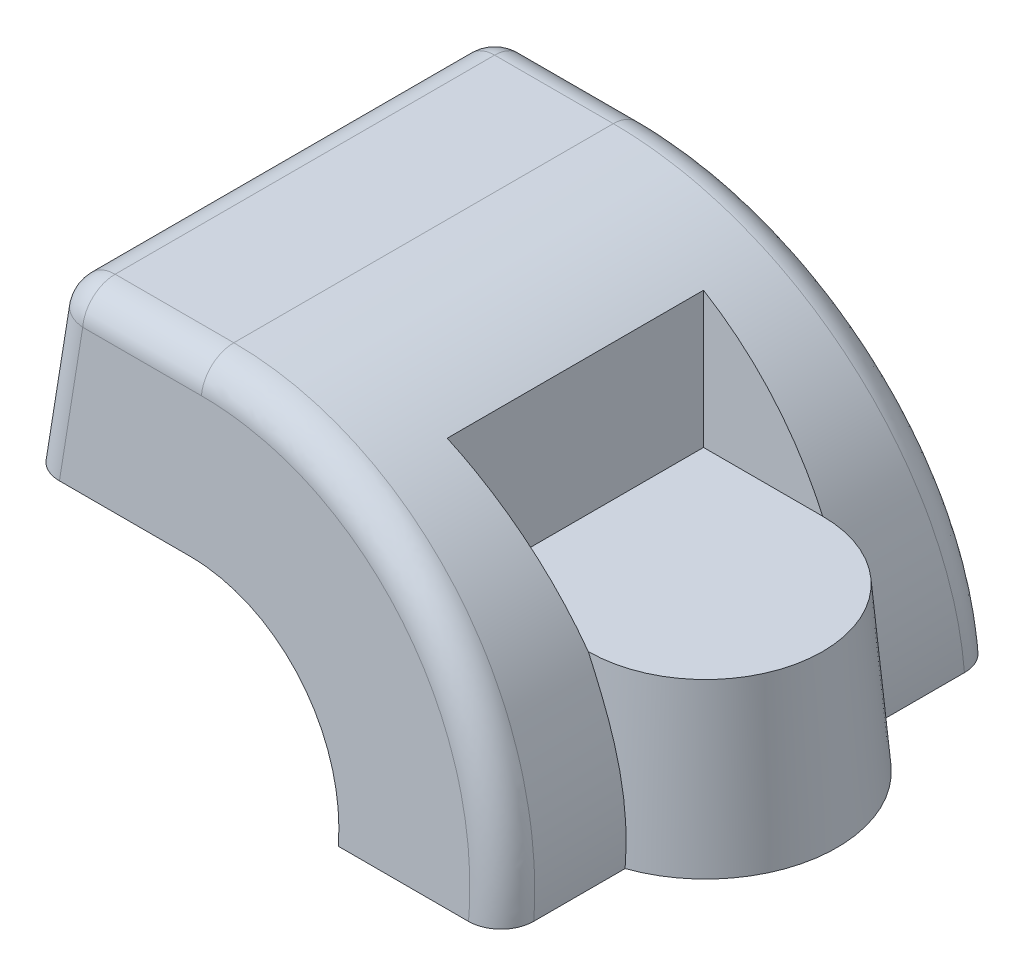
ISO-10303-21;
HEADER;
FILE_DESCRIPTION(('STEP AP214'),'2;1');
FILE_NAME('part.step','',(''),(''),'','','');
FILE_SCHEMA(('AUTOMOTIVE_DESIGN { 1 0 10303 214 1 1 1 1 }'));
ENDSEC;
DATA;
#1=APPLICATION_CONTEXT('core data for automotive mechanical design processes');
#2=APPLICATION_PROTOCOL_DEFINITION('international standard','automotive_design',2000,#1);
#3=PRODUCT_CONTEXT('',#1,'mechanical');
#4=PRODUCT('Part','Part','',(#3));
#5=PRODUCT_RELATED_PRODUCT_CATEGORY('part','',(#4));
#6=PRODUCT_DEFINITION_FORMATION('','',#4);
#7=PRODUCT_DEFINITION_CONTEXT('part definition',#1,'design');
#8=PRODUCT_DEFINITION('design','',#6,#7);
#9=PRODUCT_DEFINITION_SHAPE('','',#8);
#10=(LENGTH_UNIT() NAMED_UNIT(*) SI_UNIT(.MILLI.,.METRE.));
#11=(NAMED_UNIT(*) PLANE_ANGLE_UNIT() SI_UNIT($,.RADIAN.));
#12=(NAMED_UNIT(*) SI_UNIT($,.STERADIAN.) SOLID_ANGLE_UNIT());
#13=UNCERTAINTY_MEASURE_WITH_UNIT(LENGTH_MEASURE(1.E-05),#10,'distance_accuracy_value','');
#14=(GEOMETRIC_REPRESENTATION_CONTEXT(3) GLOBAL_UNCERTAINTY_ASSIGNED_CONTEXT((#13)) GLOBAL_UNIT_ASSIGNED_CONTEXT((#10,
#11,#12)) REPRESENTATION_CONTEXT('',''));
#15=CARTESIAN_POINT('',(0.,0.,0.));
#16=DIRECTION('',(0.,0.,1.));
#17=DIRECTION('',(1.,0.,0.));
#18=AXIS2_PLACEMENT_3D('',#15,#16,#17);
#19=CARTESIAN_POINT('',(-25.,25.,38.1));
#20=DIRECTION('',(-0.996194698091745,0.0871557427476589,0.));
#21=DIRECTION('',(-0.0871557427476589,-0.996194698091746,0.));
#22=AXIS2_PLACEMENT_3D('',#19,#20,#21);
#23=PLANE('',#22);
#24=DIRECTION('',(0.,0.,-1.));
#25=VECTOR('',#24,1.);
#26=CARTESIAN_POINT('',(-23.2121010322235,45.4357787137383,38.1));
#27=LINE('',#26,#25);
#28=CARTESIAN_POINT('',(-23.2121010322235,45.4357787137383,29.1439109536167));
#29=VERTEX_POINT('',#28);
#30=CARTESIAN_POINT('',(-23.2121010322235,45.4357787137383,-29.1439109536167));
#31=VERTEX_POINT('',#30);
#32=EDGE_CURVE('E342',#29,#31,#27,.T.);
#33=ORIENTED_EDGE('',*,*,#32,.T.);
#34=DIRECTION('',(-0.0868265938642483,-0.992432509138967,-0.0868265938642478));
#35=VECTOR('',#34,1.);
#36=CARTESIAN_POINT('',(-25.037550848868,24.5707918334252,-30.9693607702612));
#37=LINE('',#36,#35);
#38=CARTESIAN_POINT('',(-25.,25.,-30.9318099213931));
#39=VERTEX_POINT('',#38);
#40=EDGE_CURVE('E346',#31,#39,#37,.T.);
#41=ORIENTED_EDGE('',*,*,#40,.T.);
#42=DIRECTION('',(0.,0.,-1.));
#43=VECTOR('',#42,1.);
#44=CARTESIAN_POINT('',(-25.,25.,38.1));
#45=LINE('',#44,#43);
#46=CARTESIAN_POINT('',(-25.,25.,30.9318099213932));
#47=VERTEX_POINT('',#46);
#48=EDGE_CURVE('E326',#47,#39,#45,.T.);
#49=ORIENTED_EDGE('',*,*,#48,.F.);
#50=DIRECTION('',(0.0868265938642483,0.992432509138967,-0.0868265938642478));
#51=VECTOR('',#50,1.);
#52=CARTESIAN_POINT('',(-25.0540399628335,24.3823203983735,30.9858498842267));
#53=LINE('',#52,#51);
#54=EDGE_CURVE('E344',#47,#29,#53,.T.);
#55=ORIENTED_EDGE('',*,*,#54,.T.);
#56=EDGE_LOOP('',(#33,#41,#49,#55));
#57=FACE_BOUND('',#56,.T.);
#58=ADVANCED_FACE('F34',(#57),#23,.T.);
#59=CARTESIAN_POINT('',(-25.,25.,38.1));
#60=DIRECTION('',(0.,1.,0.));
#61=DIRECTION('',(-1.,0.,0.));
#62=AXIS2_PLACEMENT_3D('',#59,#60,#61);
#63=PLANE('',#62);
#64=ORIENTED_EDGE('',*,*,#48,.T.);
#65=CARTESIAN_POINT('',(-19.9809008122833,25.,-30.8936842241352));
#66=DIRECTION('',(0.,1.,0.));
#67=DIRECTION('',(-0.707106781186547,0.,-0.707106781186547));
#68=AXIS2_PLACEMENT_3D('',#65,#66,#67);
#69=ELLIPSE('',#68,5.03812597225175,5.);
#70=CARTESIAN_POINT('',(-20.0190265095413,25.,-35.9127834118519));
#71=VERTEX_POINT('',#70);
#72=EDGE_CURVE('E350',#39,#71,#69,.F.);
#73=ORIENTED_EDGE('',*,*,#72,.T.);
#74=DIRECTION('',(1.,0.,0.));
#75=VECTOR('',#74,1.);
#76=CARTESIAN_POINT('',(0.,25.,-35.9127834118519));
#77=LINE('',#76,#75);
#78=CARTESIAN_POINT('',(0.,25.,-35.9127834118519));
#79=VERTEX_POINT('',#78);
#80=EDGE_CURVE('E262',#71,#79,#77,.T.);
#81=ORIENTED_EDGE('',*,*,#80,.T.);
#82=DIRECTION('',(0.,0.,-1.));
#83=VECTOR('',#82,1.);
#84=CARTESIAN_POINT('',(0.,25.,38.1));
#85=LINE('',#84,#83);
#86=CARTESIAN_POINT('',(0.,25.,35.9127834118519));
#87=VERTEX_POINT('',#86);
#88=EDGE_CURVE('E303',#87,#79,#85,.T.);
#89=ORIENTED_EDGE('',*,*,#88,.F.);
#90=DIRECTION('',(-1.,0.,0.));
#91=VECTOR('',#90,1.);
#92=CARTESIAN_POINT('',(0.,25.,35.9127834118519));
#93=LINE('',#92,#91);
#94=CARTESIAN_POINT('',(-20.0190265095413,25.,35.9127834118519));
#95=VERTEX_POINT('',#94);
#96=EDGE_CURVE('E314',#95,#87,#93,.F.);
#97=ORIENTED_EDGE('',*,*,#96,.F.);
#98=CARTESIAN_POINT('',(-19.9809008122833,25.,30.8936842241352));
#99=DIRECTION('',(0.,1.,0.));
#100=DIRECTION('',(-0.707106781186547,0.,0.707106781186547));
#101=AXIS2_PLACEMENT_3D('',#98,#99,#100);
#102=ELLIPSE('',#101,5.03812597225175,5.);
#103=EDGE_CURVE('E348',#95,#47,#102,.F.);
#104=ORIENTED_EDGE('',*,*,#103,.T.);
#105=EDGE_LOOP('',(#64,#73,#81,#89,#97,#104));
#106=FACE_BOUND('',#105,.T.);
#107=ADVANCED_FACE('F217',(#106),#63,.F.);
#108=CARTESIAN_POINT('',(0.,0.,38.1));
#109=DIRECTION('',(0.,0.,-1.));
#110=DIRECTION('',(-1.,0.,0.));
#111=AXIS2_PLACEMENT_3D('',#108,#109,#110);
#112=CYLINDRICAL_SURFACE('',#111,25.);
#113=CARTESIAN_POINT('',(0.,0.,-38.1));
#114=DIRECTION('',(0.,0.0871557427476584,-0.996194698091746));
#115=DIRECTION('',(0.,-0.996194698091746,-0.0871557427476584));
#116=AXIS2_PLACEMENT_3D('',#113,#114,#115);
#117=ELLIPSE('',#116,25.0954959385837,25.);
#118=CARTESIAN_POINT('',(25.,0.,-38.1));
#119=VERTEX_POINT('',#118);
#120=EDGE_CURVE('E297',#79,#119,#117,.T.);
#121=ORIENTED_EDGE('',*,*,#120,.T.);
#122=DIRECTION('',(0.,0.,-1.));
#123=VECTOR('',#122,1.);
#124=CARTESIAN_POINT('',(25.,0.,38.1));
#125=LINE('',#124,#123);
#126=CARTESIAN_POINT('',(25.,0.,38.1));
#127=VERTEX_POINT('',#126);
#128=EDGE_CURVE('E300',#127,#119,#125,.T.);
#129=ORIENTED_EDGE('',*,*,#128,.F.);
#130=CARTESIAN_POINT('',(0.,0.,38.1));
#131=DIRECTION('',(0.,0.0871557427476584,0.996194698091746));
#132=DIRECTION('',(0.,0.996194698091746,-0.0871557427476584));
#133=AXIS2_PLACEMENT_3D('',#130,#131,#132);
#134=ELLIPSE('',#133,25.0954959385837,25.);
#135=EDGE_CURVE('E316',#87,#127,#134,.F.);
#136=ORIENTED_EDGE('',*,*,#135,.F.);
#137=ORIENTED_EDGE('',*,*,#88,.T.);
#138=EDGE_LOOP('',(#121,#129,#136,#137));
#139=FACE_BOUND('',#138,.T.);
#140=ADVANCED_FACE('F223',(#139),#112,.F.);
#141=CARTESIAN_POINT('',(25.,0.,38.1));
#142=DIRECTION('',(0.,1.,0.));
#143=DIRECTION('',(-1.,0.,0.));
#144=AXIS2_PLACEMENT_3D('',#141,#142,#143);
#145=PLANE('',#144);
#146=CARTESIAN_POINT('',(43.3012701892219,0.,0.));
#147=DIRECTION('',(0.,-1.,0.));
#148=DIRECTION('',(1.,0.,0.));
#149=AXIS2_PLACEMENT_3D('',#146,#147,#148);
#150=CIRCLE('',#149,20.1872165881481);
#151=CARTESIAN_POINT('',(50.,0.,19.0433907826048));
#152=VERTEX_POINT('',#151);
#153=CARTESIAN_POINT('',(50.,0.,-19.0433907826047));
#154=VERTEX_POINT('',#153);
#155=EDGE_CURVE('E169',#152,#154,#150,.F.);
#156=ORIENTED_EDGE('',*,*,#155,.F.);
#157=DIRECTION('',(0.,0.,-1.));
#158=VECTOR('',#157,1.);
#159=CARTESIAN_POINT('',(50.,0.,38.1));
#160=LINE('',#159,#158);
#161=CARTESIAN_POINT('',(50.,0.,33.0809008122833));
#162=VERTEX_POINT('',#161);
#163=EDGE_CURVE('E60',#162,#152,#160,.T.);
#164=ORIENTED_EDGE('',*,*,#163,.F.);
#165=CARTESIAN_POINT('',(0.,50.,29.1439109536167));
#166=CARTESIAN_POINT('',(0.,50.,33.7255668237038));
#167=CARTESIAN_POINT('',(0.,45.4357787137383,34.1248844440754));
#168=CARTESIAN_POINT('',(-2.1817052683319,50.,29.1439109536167));
#169=CARTESIAN_POINT('',(-2.16421312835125,50.,33.7255668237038));
#170=CARTESIAN_POINT('',(-1.96353474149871,45.4357787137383,34.1248844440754));
#171=CARTESIAN_POINT('',(-4.36341053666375,49.8569940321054,29.1551712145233));
#172=CARTESIAN_POINT('',(-4.32892246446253,49.8592306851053,33.7378825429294));
#173=CARTESIAN_POINT('',(-3.92706948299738,45.3070733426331,34.136144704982));
#174=CARTESIAN_POINT('',(-8.68948830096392,49.2874552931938,29.2000165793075));
#175=CARTESIAN_POINT('',(-8.62113775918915,49.2987589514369,33.7869174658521));
#176=CARTESIAN_POINT('',(-7.82053947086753,44.7944884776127,34.1809900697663));
#177=CARTESIAN_POINT('',(-10.8338559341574,48.8608858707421,29.2336045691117));
#178=CARTESIAN_POINT('',(-10.7495990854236,48.8787653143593,33.8236621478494));
#179=CARTESIAN_POINT('',(-9.75047034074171,44.4105759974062,34.2145780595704));
#180=CARTESIAN_POINT('',(-15.0485746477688,47.7315557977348,29.3225277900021));
#181=CARTESIAN_POINT('',(-14.933756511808,47.7670237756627,33.9209269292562));
#182=CARTESIAN_POINT('',(-13.5437171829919,43.3941789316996,34.3035012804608));
#183=CARTESIAN_POINT('',(-17.1189071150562,47.0287262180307,29.3778684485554));
#184=CARTESIAN_POINT('',(-16.9902995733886,47.0747134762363,33.9814962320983));
#185=CARTESIAN_POINT('',(-15.4070164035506,42.761632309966,34.3588419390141));
#186=CARTESIAN_POINT('',(-21.1501472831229,45.3589324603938,29.509347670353));
#187=CARTESIAN_POINT('',(-20.9962690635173,45.429967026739,34.1253929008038));
#188=CARTESIAN_POINT('',(-19.0351325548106,41.2588179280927,34.4903211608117));
#189=CARTESIAN_POINT('',(-23.1110161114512,44.3918751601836,29.5854935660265));
#190=CARTESIAN_POINT('',(-22.9463706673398,44.4767358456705,34.2087898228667));
#191=CARTESIAN_POINT('',(-20.799914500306,40.3884663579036,34.5664670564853));
#192=CARTESIAN_POINT('',(-26.8897996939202,42.2101942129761,29.7572786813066));
#193=CARTESIAN_POINT('',(-26.7068563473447,42.3260364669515,34.3969516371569));
#194=CARTESIAN_POINT('',(-24.2008197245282,38.4249535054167,34.7382521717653));
#195=CARTESIAN_POINT('',(-28.7076523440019,40.995463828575,29.8529263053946));
#196=CARTESIAN_POINT('',(-28.5176929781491,41.1275947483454,34.5018017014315));
#197=CARTESIAN_POINT('',(-25.8368871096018,37.3316961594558,34.8338997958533));
#198=CARTESIAN_POINT('',(-32.1693233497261,38.3392311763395,30.0620775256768));
#199=CARTESIAN_POINT('',(-31.9693103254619,38.5063727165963,34.7311289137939));
#200=CARTESIAN_POINT('',(-28.9523910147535,34.9410867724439,35.0430510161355));
#201=CARTESIAN_POINT('',(-33.8130575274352,36.897620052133,30.1755896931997));
#202=CARTESIAN_POINT('',(-33.6102862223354,37.082506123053,34.8557010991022));
#203=CARTESIAN_POINT('',(-30.4317517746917,33.643636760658,35.1565631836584));
#204=CARTESIAN_POINT('',(-36.8983882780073,33.8122903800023,30.4185279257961));
#205=CARTESIAN_POINT('',(-36.6945841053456,34.0340340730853,35.12240784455));
#206=CARTESIAN_POINT('',(-33.2085494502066,30.8668400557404,35.3995014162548));
#207=CARTESIAN_POINT('',(-38.3398838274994,32.1684715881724,30.5479618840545));
#208=CARTESIAN_POINT('',(-38.137827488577,32.4083021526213,35.2646409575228));
#209=CARTESIAN_POINT('',(-34.5058954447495,29.3874031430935,35.5289353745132));
#210=CARTESIAN_POINT('',(-40.9960879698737,28.7068401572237,30.8205300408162));
#211=CARTESIAN_POINT('',(-40.8022412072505,28.9830392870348,35.564312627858));
#212=CARTESIAN_POINT('',(-36.8964791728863,26.2719348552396,35.8015035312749));
#213=CARTESIAN_POINT('',(-42.2106872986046,26.8889443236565,30.9636707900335));
#214=CARTESIAN_POINT('',(-42.0230619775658,27.1824160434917,35.7218467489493));
#215=CARTESIAN_POINT('',(-37.9896185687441,24.6358286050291,35.9446442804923));
#216=CARTESIAN_POINT('',(-44.3923222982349,23.1102429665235,31.2612049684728));
#217=CARTESIAN_POINT('',(-44.2217845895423,23.4372409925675,36.0495071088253));
#218=CARTESIAN_POINT('',(-39.9530900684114,21.2349973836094,36.2421784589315));
#219=CARTESIAN_POINT('',(-45.3592512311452,21.1493762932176,31.4156032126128));
#220=CARTESIAN_POINT('',(-45.1990874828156,21.4917021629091,36.2197197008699));
#221=CARTESIAN_POINT('',(-40.8233261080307,19.4702173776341,36.3965767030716));
#222=CARTESIAN_POINT('',(-47.0289950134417,17.1182595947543,31.7330125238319));
#223=CARTESIAN_POINT('',(-46.8938478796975,17.4890439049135,36.5699069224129));
#224=CARTESIAN_POINT('',(-42.3260955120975,15.8422123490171,36.7139860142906));
#225=CARTESIAN_POINT('',(-47.731717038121,15.0479714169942,31.8960265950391));
#226=CARTESIAN_POINT('',(-47.6104956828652,15.4311059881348,36.7499531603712));
#227=CARTESIAN_POINT('',(-42.9585453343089,13.9789529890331,36.8770000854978));
#228=CARTESIAN_POINT('',(-48.8610056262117,10.8334104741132,32.2278802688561));
#229=CARTESIAN_POINT('',(-48.7712329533,11.237982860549,37.1168038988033));
#230=CARTESIAN_POINT('',(-43.9749050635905,10.1858481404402,37.2088537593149));
#231=CARTESIAN_POINT('',(-49.2875036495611,8.68911948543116,32.3967213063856));
#232=CARTESIAN_POINT('',(-49.2143549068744,9.10219914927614,37.303660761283));
#233=CARTESIAN_POINT('',(-44.358753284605,8.25598625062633,37.3776947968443));
#234=CARTESIAN_POINT('',(-49.8570190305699,4.36322216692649,32.7373415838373));
#235=CARTESIAN_POINT('',(-49.8197793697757,4.7891763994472,37.6810013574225));
#236=CARTESIAN_POINT('',(-44.8713171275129,4.36267866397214,37.718315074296));
#237=CARTESIAN_POINT('',(-50.,2.18161108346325,32.9091211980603));
#238=CARTESIAN_POINT('',(-49.9810202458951,2.61159539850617,37.8715150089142));
#239=CARTESIAN_POINT('',(-45.0000000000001,2.39922868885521,37.890094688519));
#240=CARTESIAN_POINT('',(-50.,-2.18161108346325,33.2526804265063));
#241=CARTESIAN_POINT('',(-50.0190520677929,-1.74832792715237,38.2529588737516));
#242=CARTESIAN_POINT('',(-45.0000000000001,-1.52767126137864,38.233653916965));
#243=CARTESIAN_POINT('',(-49.8570190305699,-4.3632221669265,33.4244600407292));
#244=CARTESIAN_POINT('',(-49.8947575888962,-3.9307361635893,38.4438948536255));
#245=CARTESIAN_POINT('',(-44.8713171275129,-3.49112123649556,38.405433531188));
#246=CARTESIAN_POINT('',(-49.2875036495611,-8.68911948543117,33.765080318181));
#247=CARTESIAN_POINT('',(-49.3628340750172,-8.26329972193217,38.822945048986));
#248=CARTESIAN_POINT('',(-44.358753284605,-7.38442882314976,38.7460538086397));
#249=CARTESIAN_POINT('',(-48.8610056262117,-10.8334104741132,33.9339213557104));
#250=CARTESIAN_POINT('',(-48.9541683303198,-10.4132435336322,39.0110407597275));
#251=CARTESIAN_POINT('',(-43.9749050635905,-9.31429071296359,38.9148948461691));
#252=CARTESIAN_POINT('',(-47.731717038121,-15.0479714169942,34.2657750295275));
#253=CARTESIAN_POINT('',(-47.8594108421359,-14.6441454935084,39.3811967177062));
#254=CARTESIAN_POINT('',(-42.9585453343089,-13.1073955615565,39.2467485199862));
#255=CARTESIAN_POINT('',(-47.0289950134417,-17.1182595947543,34.4287891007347));
#256=CARTESIAN_POINT('',(-47.1724012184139,-16.7246315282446,39.5632156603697));
#257=CARTESIAN_POINT('',(-42.3260955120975,-14.9706549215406,39.4097625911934));
#258=CARTESIAN_POINT('',(-45.3592512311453,-21.1493762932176,34.7461984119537));
#259=CARTESIAN_POINT('',(-45.5316323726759,-20.7807822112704,39.9180828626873));
#260=CARTESIAN_POINT('',(-40.8233261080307,-18.5986599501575,39.7271719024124));
#261=CARTESIAN_POINT('',(-44.3923222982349,-23.1102429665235,34.9005966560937));
#262=CARTESIAN_POINT('',(-44.5771373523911,-22.7557481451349,40.0908699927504));
#263=CARTESIAN_POINT('',(-39.9530900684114,-20.3634399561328,39.8815701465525));
#264=CARTESIAN_POINT('',(-42.2106872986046,-26.8889443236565,35.198130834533));
#265=CARTESIAN_POINT('',(-42.4167389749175,-26.5665418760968,40.4242712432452));
#266=CARTESIAN_POINT('',(-37.9896185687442,-23.7642711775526,40.1791043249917));
#267=CARTESIAN_POINT('',(-40.9960879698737,-28.7068401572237,35.3412715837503));
#268=CARTESIAN_POINT('',(-41.2103341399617,-28.4014935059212,40.5848087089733));
#269=CARTESIAN_POINT('',(-36.8964791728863,-25.400377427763,40.322245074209));
#270=CARTESIAN_POINT('',(-38.3398838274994,-32.1684715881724,35.613839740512));
#271=CARTESIAN_POINT('',(-38.565936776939,-31.9000800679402,40.8908953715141));
#272=CARTESIAN_POINT('',(-34.5058954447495,-28.5158457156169,40.5948132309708));
#273=CARTESIAN_POINT('',(-36.8983882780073,-33.8122903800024,35.7432736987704));
#274=CARTESIAN_POINT('',(-37.1277147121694,-33.5627226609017,41.0363577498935));
#275=CARTESIAN_POINT('',(-33.2085494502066,-29.9952826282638,40.7242471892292));
#276=CARTESIAN_POINT('',(-33.8130575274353,-36.897620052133,35.9862119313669));
#277=CARTESIAN_POINT('',(-34.0437108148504,-36.6872560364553,41.3097189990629));
#278=CARTESIAN_POINT('',(-30.4317517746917,-32.7720793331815,40.9671854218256));
#279=CARTESIAN_POINT('',(-32.1693233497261,-38.3392311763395,36.0997240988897));
#280=CARTESIAN_POINT('',(-32.3979915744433,-38.1481078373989,41.4375269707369));
#281=CARTESIAN_POINT('',(-28.9523910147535,-34.0695293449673,41.0806975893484));
#282=CARTESIAN_POINT('',(-28.707652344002,-40.995463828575,36.3088753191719));
#283=CARTESIAN_POINT('',(-28.9268672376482,-40.842945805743,41.6732947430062));
#284=CARTESIAN_POINT('',(-25.8368871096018,-36.4601387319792,41.2898488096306));
#285=CARTESIAN_POINT('',(-26.8897996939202,-42.2101942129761,36.4045229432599));
#286=CARTESIAN_POINT('',(-27.1018178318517,-42.0759195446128,41.7811659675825));
#287=CARTESIAN_POINT('',(-24.2008197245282,-37.5533960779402,41.3854964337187));
#288=CARTESIAN_POINT('',(-23.1110161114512,-44.3918751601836,36.57630805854));
#289=CARTESIAN_POINT('',(-23.3033025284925,-44.2927437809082,41.9751129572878));
#290=CARTESIAN_POINT('',(-20.799914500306,-39.516908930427,41.5572815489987));
#291=CARTESIAN_POINT('',(-21.1501472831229,-45.3589324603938,36.6524539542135));
#292=CARTESIAN_POINT('',(-21.330466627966,-45.2756802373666,42.0611087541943));
#293=CARTESIAN_POINT('',(-19.0351325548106,-40.3872605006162,41.6334274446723));
#294=CARTESIAN_POINT('',(-17.1189071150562,-47.0287262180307,36.7839331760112));
#295=CARTESIAN_POINT('',(-17.270506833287,-46.9745035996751,42.2097365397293));
#296=CARTESIAN_POINT('',(-15.4070164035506,-41.8900748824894,41.7649066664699));
#297=CARTESIAN_POINT('',(-15.0485746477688,-47.7315557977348,36.8392738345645));
#298=CARTESIAN_POINT('',(-15.1842495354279,-47.6896401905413,42.2723028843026));
#299=CARTESIAN_POINT('',(-13.5437171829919,-42.522621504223,41.8202473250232));
#300=CARTESIAN_POINT('',(-10.8338559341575,-48.8608858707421,36.9281970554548));
#301=CARTESIAN_POINT('',(-10.9338202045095,-48.8396667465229,42.3729171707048));
#302=CARTESIAN_POINT('',(-9.75047034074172,-43.5390185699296,41.9091705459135));
#303=CARTESIAN_POINT('',(-8.68948830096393,-49.2874552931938,36.961785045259));
#304=CARTESIAN_POINT('',(-8.77069702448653,-49.2740241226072,42.4109185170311));
#305=CARTESIAN_POINT('',(-7.82053947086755,-43.9229310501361,41.9427585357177));
#306=CARTESIAN_POINT('',(-4.36341053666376,-49.8569940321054,37.0066304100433));
#307=CARTESIAN_POINT('',(-4.40447389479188,-49.8543289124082,42.4616886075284));
#308=CARTESIAN_POINT('',(-3.92706948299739,-44.4355159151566,41.987603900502));
#309=CARTESIAN_POINT('',(-2.18170526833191,-50.,37.0178906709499));
#310=CARTESIAN_POINT('',(-2.20253769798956,-50.,42.4744331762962));
#311=CARTESIAN_POINT('',(-1.96353474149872,-44.5642212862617,41.9988641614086));
#312=CARTESIAN_POINT('',(2.1817052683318,-50.,37.0178906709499));
#313=CARTESIAN_POINT('',(2.20253769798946,-50.,42.4744331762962));
#314=CARTESIAN_POINT('',(1.96353474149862,-44.5642212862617,41.9988641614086));
#315=CARTESIAN_POINT('',(4.36341053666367,-49.8569940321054,37.0066304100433));
#316=CARTESIAN_POINT('',(4.40447389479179,-49.8543289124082,42.4616886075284));
#317=CARTESIAN_POINT('',(3.9270694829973,-44.4355159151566,41.987603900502));
#318=CARTESIAN_POINT('',(8.68948830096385,-49.2874552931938,36.961785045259));
#319=CARTESIAN_POINT('',(8.77069702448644,-49.2740241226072,42.4109185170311));
#320=CARTESIAN_POINT('',(7.82053947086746,-43.9229310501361,41.9427585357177));
#321=CARTESIAN_POINT('',(10.8338559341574,-48.8608858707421,36.9281970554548));
#322=CARTESIAN_POINT('',(10.9338202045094,-48.8396667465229,42.3729171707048));
#323=CARTESIAN_POINT('',(9.75047034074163,-43.5390185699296,41.9091705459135));
#324=CARTESIAN_POINT('',(15.0485746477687,-47.7315557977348,36.8392738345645));
#325=CARTESIAN_POINT('',(15.1842495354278,-47.6896401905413,42.2723028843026));
#326=CARTESIAN_POINT('',(13.5437171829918,-42.522621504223,41.8202473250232));
#327=CARTESIAN_POINT('',(17.1189071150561,-47.0287262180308,36.7839331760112));
#328=CARTESIAN_POINT('',(17.2705068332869,-46.9745035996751,42.2097365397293));
#329=CARTESIAN_POINT('',(15.4070164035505,-41.8900748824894,41.7649066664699));
#330=CARTESIAN_POINT('',(21.1501472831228,-45.3589324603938,36.6524539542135));
#331=CARTESIAN_POINT('',(21.3304666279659,-45.2756802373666,42.0611087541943));
#332=CARTESIAN_POINT('',(19.0351325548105,-40.3872605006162,41.6334274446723));
#333=CARTESIAN_POINT('',(23.1110161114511,-44.3918751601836,36.57630805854));
#334=CARTESIAN_POINT('',(23.3033025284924,-44.2927437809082,41.9751129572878));
#335=CARTESIAN_POINT('',(20.7999145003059,-39.516908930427,41.5572815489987));
#336=CARTESIAN_POINT('',(26.8897996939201,-42.2101942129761,36.4045229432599));
#337=CARTESIAN_POINT('',(27.1018178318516,-42.0759195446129,41.7811659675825));
#338=CARTESIAN_POINT('',(24.2008197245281,-37.5533960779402,41.3854964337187));
#339=CARTESIAN_POINT('',(28.7076523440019,-40.995463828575,36.3088753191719));
#340=CARTESIAN_POINT('',(28.9268672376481,-40.842945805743,41.6732947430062));
#341=CARTESIAN_POINT('',(25.8368871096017,-36.4601387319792,41.2898488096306));
#342=CARTESIAN_POINT('',(32.169323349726,-38.3392311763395,36.0997240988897));
#343=CARTESIAN_POINT('',(32.3979915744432,-38.1481078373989,41.4375269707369));
#344=CARTESIAN_POINT('',(28.9523910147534,-34.0695293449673,41.0806975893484));
#345=CARTESIAN_POINT('',(33.8130575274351,-36.8976200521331,35.9862119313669));
#346=CARTESIAN_POINT('',(34.0437108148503,-36.6872560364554,41.3097189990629));
#347=CARTESIAN_POINT('',(30.4317517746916,-32.7720793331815,40.9671854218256));
#348=CARTESIAN_POINT('',(36.8983882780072,-33.8122903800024,35.7432736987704));
#349=CARTESIAN_POINT('',(37.1277147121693,-33.5627226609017,41.0363577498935));
#350=CARTESIAN_POINT('',(33.2085494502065,-29.9952826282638,40.7242471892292));
#351=CARTESIAN_POINT('',(38.3398838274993,-32.1684715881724,35.613839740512));
#352=CARTESIAN_POINT('',(38.5659367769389,-31.9000800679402,40.8908953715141));
#353=CARTESIAN_POINT('',(34.5058954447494,-28.5158457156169,40.5948132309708));
#354=CARTESIAN_POINT('',(40.9960879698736,-28.7068401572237,35.3412715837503));
#355=CARTESIAN_POINT('',(41.2103341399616,-28.4014935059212,40.5848087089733));
#356=CARTESIAN_POINT('',(36.8964791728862,-25.4003774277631,40.322245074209));
#357=CARTESIAN_POINT('',(42.2106872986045,-26.8889443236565,35.198130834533));
#358=CARTESIAN_POINT('',(42.4167389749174,-26.5665418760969,40.4242712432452));
#359=CARTESIAN_POINT('',(37.9896185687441,-23.7642711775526,40.1791043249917));
#360=CARTESIAN_POINT('',(44.3923222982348,-23.1102429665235,34.9005966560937));
#361=CARTESIAN_POINT('',(44.5771373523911,-22.7557481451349,40.0908699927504));
#362=CARTESIAN_POINT('',(39.9530900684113,-20.3634399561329,39.8815701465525));
#363=CARTESIAN_POINT('',(45.3592512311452,-21.1493762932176,34.7461984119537));
#364=CARTESIAN_POINT('',(45.5316323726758,-20.7807822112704,39.9180828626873));
#365=CARTESIAN_POINT('',(40.8233261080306,-18.5986599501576,39.7271719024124));
#366=CARTESIAN_POINT('',(47.0289950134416,-17.1182595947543,34.4287891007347));
#367=CARTESIAN_POINT('',(47.1724012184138,-16.7246315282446,39.5632156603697));
#368=CARTESIAN_POINT('',(42.3260955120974,-14.9706549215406,39.4097625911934));
#369=CARTESIAN_POINT('',(47.7317170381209,-15.0479714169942,34.2657750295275));
#370=CARTESIAN_POINT('',(47.8594108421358,-14.6441454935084,39.3811967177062));
#371=CARTESIAN_POINT('',(42.9585453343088,-13.1073955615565,39.2467485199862));
#372=CARTESIAN_POINT('',(48.8610056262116,-10.8334104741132,33.9339213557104));
#373=CARTESIAN_POINT('',(48.9541683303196,-10.4132435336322,39.0110407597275));
#374=CARTESIAN_POINT('',(43.9749050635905,-9.31429071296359,38.9148948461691));
#375=CARTESIAN_POINT('',(49.287503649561,-8.68911948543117,33.765080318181));
#376=CARTESIAN_POINT('',(49.3628340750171,-8.26329972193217,38.822945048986));
#377=CARTESIAN_POINT('',(44.3587532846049,-7.38442882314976,38.7460538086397));
#378=CARTESIAN_POINT('',(49.8570190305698,-4.3632221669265,33.4244600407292));
#379=CARTESIAN_POINT('',(49.8947575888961,-3.9307361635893,38.4438948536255));
#380=CARTESIAN_POINT('',(44.8713171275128,-3.49112123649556,38.405433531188));
#381=CARTESIAN_POINT('',(50.,-2.18161108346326,33.2526804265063));
#382=CARTESIAN_POINT('',(50.0190520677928,-1.74832792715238,38.2529588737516));
#383=CARTESIAN_POINT('',(45.,-1.52767126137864,38.233653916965));
#384=CARTESIAN_POINT('',(50.,2.18161108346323,32.9091211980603));
#385=CARTESIAN_POINT('',(49.9810202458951,2.61159539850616,37.8715150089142));
#386=CARTESIAN_POINT('',(45.,2.3992286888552,37.890094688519));
#387=CARTESIAN_POINT('',(49.8570190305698,4.36322216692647,32.7373415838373));
#388=CARTESIAN_POINT('',(49.8197793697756,4.78917639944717,37.6810013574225));
#389=CARTESIAN_POINT('',(44.8713171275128,4.36267866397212,37.718315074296));
#390=CARTESIAN_POINT('',(49.287503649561,8.68911948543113,32.3967213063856));
#391=CARTESIAN_POINT('',(49.2143549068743,9.10219914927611,37.303660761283));
#392=CARTESIAN_POINT('',(44.3587532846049,8.25598625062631,37.3776947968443));
#393=CARTESIAN_POINT('',(48.8610056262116,10.8334104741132,32.2278802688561));
#394=CARTESIAN_POINT('',(48.7712329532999,11.237982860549,37.1168038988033));
#395=CARTESIAN_POINT('',(43.9749050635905,10.1858481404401,37.2088537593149));
#396=CARTESIAN_POINT('',(47.7317170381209,15.0479714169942,31.8960265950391));
#397=CARTESIAN_POINT('',(47.6104956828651,15.4311059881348,36.7499531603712));
#398=CARTESIAN_POINT('',(42.9585453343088,13.9789529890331,36.8770000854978));
#399=CARTESIAN_POINT('',(47.0289950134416,17.1182595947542,31.7330125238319));
#400=CARTESIAN_POINT('',(46.8938478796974,17.4890439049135,36.5699069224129));
#401=CARTESIAN_POINT('',(42.3260955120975,15.8422123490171,36.7139860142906));
#402=CARTESIAN_POINT('',(45.3592512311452,21.1493762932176,31.4156032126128));
#403=CARTESIAN_POINT('',(45.1990874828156,21.4917021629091,36.2197197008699));
#404=CARTESIAN_POINT('',(40.8233261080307,19.4702173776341,36.3965767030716));
#405=CARTESIAN_POINT('',(44.3923222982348,23.1102429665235,31.2612049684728));
#406=CARTESIAN_POINT('',(44.2217845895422,23.4372409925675,36.0495071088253));
#407=CARTESIAN_POINT('',(39.9530900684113,21.2349973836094,36.2421784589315));
#408=CARTESIAN_POINT('',(42.2106872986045,26.8889443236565,30.9636707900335));
#409=CARTESIAN_POINT('',(42.0230619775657,27.1824160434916,35.7218467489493));
#410=CARTESIAN_POINT('',(37.9896185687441,24.6358286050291,35.9446442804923));
#411=CARTESIAN_POINT('',(40.9960879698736,28.7068401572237,30.8205300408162));
#412=CARTESIAN_POINT('',(40.8022412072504,28.9830392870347,35.564312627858));
#413=CARTESIAN_POINT('',(36.8964791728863,26.2719348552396,35.8015035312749));
#414=CARTESIAN_POINT('',(38.3398838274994,32.1684715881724,30.5479618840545));
#415=CARTESIAN_POINT('',(38.1378274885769,32.4083021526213,35.2646409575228));
#416=CARTESIAN_POINT('',(34.5058954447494,29.3874031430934,35.5289353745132));
#417=CARTESIAN_POINT('',(36.8983882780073,33.8122903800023,30.4185279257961));
#418=CARTESIAN_POINT('',(36.6945841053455,34.0340340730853,35.12240784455));
#419=CARTESIAN_POINT('',(33.2085494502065,30.8668400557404,35.3995014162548));
#420=CARTESIAN_POINT('',(33.8130575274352,36.897620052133,30.1755896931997));
#421=CARTESIAN_POINT('',(33.6102862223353,37.082506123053,34.8557010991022));
#422=CARTESIAN_POINT('',(30.4317517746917,33.643636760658,35.1565631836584));
#423=CARTESIAN_POINT('',(32.169323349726,38.3392311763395,30.0620775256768));
#424=CARTESIAN_POINT('',(31.9693103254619,38.5063727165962,34.7311289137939));
#425=CARTESIAN_POINT('',(28.9523910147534,34.9410867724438,35.0430510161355));
#426=CARTESIAN_POINT('',(28.7076523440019,40.995463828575,29.8529263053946));
#427=CARTESIAN_POINT('',(28.5176929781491,41.1275947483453,34.5018017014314));
#428=CARTESIAN_POINT('',(25.8368871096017,37.3316961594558,34.8338997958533));
#429=CARTESIAN_POINT('',(26.8897996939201,42.2101942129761,29.7572786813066));
#430=CARTESIAN_POINT('',(26.7068563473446,42.3260364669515,34.3969516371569));
#431=CARTESIAN_POINT('',(24.2008197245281,38.4249535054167,34.7382521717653));
#432=CARTESIAN_POINT('',(23.1110161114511,44.3918751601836,29.5854935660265));
#433=CARTESIAN_POINT('',(22.9463706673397,44.4767358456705,34.2087898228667));
#434=CARTESIAN_POINT('',(20.799914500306,40.3884663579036,34.5664670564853));
#435=CARTESIAN_POINT('',(21.1501472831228,45.3589324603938,29.509347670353));
#436=CARTESIAN_POINT('',(20.9962690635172,45.429967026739,34.1253929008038));
#437=CARTESIAN_POINT('',(19.0351325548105,41.2588179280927,34.4903211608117));
#438=CARTESIAN_POINT('',(17.1189071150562,47.0287262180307,29.3778684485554));
#439=CARTESIAN_POINT('',(16.9902995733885,47.0747134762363,33.9814962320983));
#440=CARTESIAN_POINT('',(15.4070164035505,42.761632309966,34.3588419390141));
#441=CARTESIAN_POINT('',(15.0485746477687,47.7315557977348,29.3225277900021));
#442=CARTESIAN_POINT('',(14.9337565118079,47.7670237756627,33.9209269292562));
#443=CARTESIAN_POINT('',(13.5437171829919,43.3941789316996,34.3035012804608));
#444=CARTESIAN_POINT('',(10.8338559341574,48.8608858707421,29.2336045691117));
#445=CARTESIAN_POINT('',(10.7495990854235,48.8787653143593,33.8236621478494));
#446=CARTESIAN_POINT('',(9.75047034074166,44.4105759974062,34.2145780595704));
#447=CARTESIAN_POINT('',(8.68948830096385,49.2874552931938,29.2000165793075));
#448=CARTESIAN_POINT('',(8.62113775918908,49.2987589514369,33.7869174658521));
#449=CARTESIAN_POINT('',(7.82053947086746,44.7944884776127,34.1809900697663));
#450=CARTESIAN_POINT('',(4.36341053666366,49.8569940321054,29.1551712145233));
#451=CARTESIAN_POINT('',(4.32892246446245,49.8592306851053,33.7378825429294));
#452=CARTESIAN_POINT('',(3.92706948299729,45.3070733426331,34.136144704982));
#453=CARTESIAN_POINT('',(2.18170526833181,50.,29.1439109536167));
#454=CARTESIAN_POINT('',(2.16421312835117,50.,33.7255668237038));
#455=CARTESIAN_POINT('',(1.96353474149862,45.4357787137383,34.1248844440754));
#456=CARTESIAN_POINT('',(0.,50.,29.1439109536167));
#457=CARTESIAN_POINT('',(0.,50.,33.7255668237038));
#458=CARTESIAN_POINT('',(0.,45.4357787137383,34.1248844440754));
#459=(BOUNDED_SURFACE() B_SPLINE_SURFACE(3,2,((#165,#166,#167),(#168,#169,#170),(#171,#172,
#173),(#174,#175,#176),(#177,#178,#179),(#180,#181,#182),(#183,#184,#185),(#186,#187,#188),
(#189,#190,#191),(#192,#193,#194),(#195,#196,#197),(#198,#199,#200),(#201,#202,#203),(#204,#205,
#206),(#207,#208,#209),(#210,#211,#212),(#213,#214,#215),(#216,#217,#218),(#219,#220,#221),
(#222,#223,#224),(#225,#226,#227),(#228,#229,#230),(#231,#232,#233),(#234,#235,#236),(#237,#238,
#239),(#240,#241,#242),(#243,#244,#245),(#246,#247,#248),(#249,#250,#251),(#252,#253,#254),
(#255,#256,#257),(#258,#259,#260),(#261,#262,#263),(#264,#265,#266),(#267,#268,#269),(#270,#271,
#272),(#273,#274,#275),(#276,#277,#278),(#279,#280,#281),(#282,#283,#284),(#285,#286,#287),
(#288,#289,#290),(#291,#292,#293),(#294,#295,#296),(#297,#298,#299),(#300,#301,#302),(#303,#304,
#305),(#306,#307,#308),(#309,#310,#311),(#312,#313,#314),(#315,#316,#317),(#318,#319,#320),
(#321,#322,#323),(#324,#325,#326),(#327,#328,#329),(#330,#331,#332),(#333,#334,#335),(#336,#337,
#338),(#339,#340,#341),(#342,#343,#344),(#345,#346,#347),(#348,#349,#350),(#351,#352,#353),
(#354,#355,#356),(#357,#358,#359),(#360,#361,#362),(#363,#364,#365),(#366,#367,#368),(#369,#370,
#371),(#372,#373,#374),(#375,#376,#377),(#378,#379,#380),(#381,#382,#383),(#384,#385,#386),
(#387,#388,#389),(#390,#391,#392),(#393,#394,#395),(#396,#397,#398),(#399,#400,#401),(#402,#403,
#404),(#405,#406,#407),(#408,#409,#410),(#411,#412,#413),(#414,#415,#416),(#417,#418,#419),
(#420,#421,#422),(#423,#424,#425),(#426,#427,#428),(#429,#430,#431),(#432,#433,#434),(#435,#436,
#437),(#438,#439,#440),(#441,#442,#443),(#444,#445,#446),(#447,#448,#449),(#450,#451,#452),
(#453,#454,#455),(#456,#457,#458)),.UNSPECIFIED.,.T.,.F.,.F.) B_SPLINE_SURFACE_WITH_KNOTS((4,2,
2,2,2,2,2,2,2,2,2,2,2,2,2,2,2,2,2,2,2,2,2,2,2,2,2,2,2,2,2,2,2,2,2,2,2,2,2,2,2,2,2,2,2,2,2,2,4),
(3,3),(0.,5.88637799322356,11.7735169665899,17.6621257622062,23.5528125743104,29.4460434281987,
35.3421104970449,41.2411123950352,47.1429477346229,53.0473223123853,58.9537693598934,
64.8616814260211,70.7703516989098,76.6790219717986,82.5869340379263,88.4933810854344,
94.3977556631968,100.299591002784,106.198592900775,112.094659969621,117.987890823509,
123.878577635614,129.76718643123,135.654325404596,141.54070339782,147.427081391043,
153.31422036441,159.202829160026,165.09351597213,170.986746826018,176.882813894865,
182.781815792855,188.683651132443,194.588025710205,200.494472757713,206.402384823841,
212.311055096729,218.219725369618,224.127637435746,230.034084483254,235.938459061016,
241.840294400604,247.739296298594,253.635363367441,259.528594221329,265.419281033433,
271.307889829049,277.195028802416,283.081406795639),(0.,1.),
.UNSPECIFIED.) GEOMETRIC_REPRESENTATION_ITEM() RATIONAL_B_SPLINE_SURFACE(((1.,0.737277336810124,
1.),(1.,0.737277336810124,1.),(1.,0.737192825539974,1.),(1.,0.736856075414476,1.),(1.,
0.736603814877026,1.),(1.,0.735935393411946,1.),(1.,0.735519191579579,1.),(1.,0.734529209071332,
1.),(1.,0.733955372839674,1.),(1.,0.732658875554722,1.),(1.,0.7319361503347,1.),(1.,
0.730352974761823,1.),(1.,0.729492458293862,1.),(1.,0.727647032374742,1.),(1.,0.726662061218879,
1.),(1.,0.724583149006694,1.),(1.,0.723489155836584,1.),(1.,0.721209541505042,1.),(1.,
0.720023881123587,1.),(1.,0.717579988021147,1.),(1.,0.71632172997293,1.),(1.,0.713753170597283,
1.),(1.,0.712442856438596,1.),(1.,0.709791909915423,1.),(1.,0.708451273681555,1.),(1.,
0.70576228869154,1.),(1.,0.704413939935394,1.),(1.,0.701732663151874,1.),(1.,0.700399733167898,
1.),(1.,0.697772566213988,1.),(1.,0.69647831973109,1.),(1.,0.693951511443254,1.),(1.,
0.692718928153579,1.),(1.,0.690337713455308,1.),(1.,0.689189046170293,1.),(1.,0.68699674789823,
1.),(1.,0.685953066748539,1.),(1.,0.683990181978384,1.),(1.,0.683070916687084,1.),(1.,
0.681374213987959,1.),(1.,0.680596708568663,1.),(1.,0.679198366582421,1.),(1.,0.678577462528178,
1.),(1.,0.677504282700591,1.),(1.,0.677051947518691,1.),(1.,0.676324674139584,1.),(1.,
0.676049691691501,1.),(1.,0.675682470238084,1.),(1.,0.67559020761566,1.),(1.,0.67559020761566,
1.),(1.,0.675682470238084,1.),(1.,0.676049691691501,1.),(1.,0.676324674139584,1.),(1.,
0.677051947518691,1.),(1.,0.677504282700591,1.),(1.,0.678577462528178,1.),(1.,0.679198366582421,
1.),(1.,0.680596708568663,1.),(1.,0.681374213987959,1.),(1.,0.683070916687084,1.),(1.,
0.683990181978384,1.),(1.,0.685953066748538,1.),(1.,0.68699674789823,1.),(1.,0.689189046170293,
1.),(1.,0.690337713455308,1.),(1.,0.692718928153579,1.),(1.,0.693951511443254,1.),(1.,
0.69647831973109,1.),(1.,0.697772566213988,1.),(1.,0.700399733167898,1.),(1.,0.701732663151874,
1.),(1.,0.704413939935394,1.),(1.,0.70576228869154,1.),(1.,0.708451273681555,1.),(1.,
0.709791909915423,1.),(1.,0.712442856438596,1.),(1.,0.713753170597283,1.),(1.,0.71632172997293,
1.),(1.,0.717579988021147,1.),(1.,0.720023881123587,1.),(1.,0.721209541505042,1.),(1.,
0.723489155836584,1.),(1.,0.724583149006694,1.),(1.,0.726662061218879,1.),(1.,0.727647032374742,
1.),(1.,0.729492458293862,1.),(1.,0.730352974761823,1.),(1.,0.731936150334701,1.),(1.,
0.732658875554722,1.),(1.,0.733955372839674,1.),(1.,0.734529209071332,1.),(1.,0.735519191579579,
1.),(1.,0.735935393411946,1.),(1.,0.736603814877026,1.),(1.,0.736856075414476,1.),(1.,
0.737192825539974,1.),(1.,0.737277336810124,1.),(1.,0.737277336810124,1.))) REPRESENTATION_ITEM('') SURFACE());
#460=CARTESIAN_POINT('',(50.,0.,33.0809008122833));
#461=CARTESIAN_POINT('',(50.000014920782,0.,33.222392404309));
#462=CARTESIAN_POINT('',(49.994035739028,0.,33.3638819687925));
#463=CARTESIAN_POINT('',(49.9701969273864,0.,33.6458509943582));
#464=CARTESIAN_POINT('',(49.9523377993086,0.,33.7863304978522));
#465=CARTESIAN_POINT('',(49.9048628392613,0.,34.0651914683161));
#466=CARTESIAN_POINT('',(49.8752549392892,0.,34.2035742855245));
#467=CARTESIAN_POINT('',(49.804494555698,0.,34.4773541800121));
#468=CARTESIAN_POINT('',(49.7633422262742,0.,34.6127512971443));
#469=CARTESIAN_POINT('',(49.6697632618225,0.,34.8796425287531));
#470=CARTESIAN_POINT('',(49.6173328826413,0.,35.0111353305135));
#471=CARTESIAN_POINT('',(49.5015529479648,0.,35.2692810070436));
#472=CARTESIAN_POINT('',(49.4381993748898,0.,35.3959320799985));
#473=CARTESIAN_POINT('',(49.3010692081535,0.,35.6433681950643));
#474=CARTESIAN_POINT('',(49.2272984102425,0.,35.7641564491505));
#475=CARTESIAN_POINT('',(49.0697997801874,0.,35.9991180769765));
#476=CARTESIAN_POINT('',(48.9860685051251,0.,36.1132891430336));
#477=CARTESIAN_POINT('',(48.8093885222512,0.,36.3339873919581));
#478=CARTESIAN_POINT('',(48.7164534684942,0.,36.4405255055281));
#479=CARTESIAN_POINT('',(48.5219213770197,0.,36.6453759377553));
#480=CARTESIAN_POINT('',(48.4203243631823,0.,36.7436882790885));
#481=CARTESIAN_POINT('',(48.2091470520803,0.,36.9314121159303));
#482=CARTESIAN_POINT('',(48.0995637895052,0.,37.0208202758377));
#483=CARTESIAN_POINT('',(47.8732667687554,0.,37.1900169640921));
#484=CARTESIAN_POINT('',(47.7565555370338,0.,37.2698088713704));
#485=CARTESIAN_POINT('',(47.5170819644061,0.,37.4190500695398));
#486=CARTESIAN_POINT('',(47.3943346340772,0.,37.4885234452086));
#487=CARTESIAN_POINT('',(47.1434559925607,0.,37.6168261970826));
#488=CARTESIAN_POINT('',(47.0153266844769,0.,37.6756594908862));
#489=CARTESIAN_POINT('',(46.7545908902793,0.,37.7822661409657));
#490=CARTESIAN_POINT('',(46.6219859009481,0.,37.8300431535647));
#491=CARTESIAN_POINT('',(46.353263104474,0.,37.9142006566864));
#492=CARTESIAN_POINT('',(46.2171461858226,0.,37.9505839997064));
#493=CARTESIAN_POINT('',(45.9021674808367,0.,38.0206215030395));
#494=CARTESIAN_POINT('',(45.7224164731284,0.,38.0503854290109));
#495=CARTESIAN_POINT('',(45.4513802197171,0.,38.0801495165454));
#496=CARTESIAN_POINT('',(45.3608459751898,0.,38.0875905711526));
#497=CARTESIAN_POINT('',(45.1795116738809,0.,38.0975152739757));
#498=CARTESIAN_POINT('',(45.0887116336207,0.,38.0999992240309));
#499=CARTESIAN_POINT('',(44.9978899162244,0.,38.1));
#500=B_SPLINE_CURVE_WITH_KNOTS('',3,(#460,#461,#462,#463,#464,#465,#466,#467,#468,#469,#470,
#471,#472,#473,#474,#475,#476,#477,#478,#479,#480,#481,#482,#483,#484,#485,#486,#487,#488,#489,
#490,#491,#492,#493,#494,#495,#496,#497,#498,#499),.UNSPECIFIED.,.F.,.F.,(4,2,2,2,2,2,2,2,2,2,2,
2,2,2,2,2,2,2,2,4),(0.,0.424345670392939,0.848673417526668,1.27271517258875,1.69675126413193,
2.12092834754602,2.54526177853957,2.96936004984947,3.39360534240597,3.81723042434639,
4.24085433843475,4.6646363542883,5.08826902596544,5.51089679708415,5.9333686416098,
6.3557005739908,6.77792668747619,7.32328642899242,7.59569098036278,7.86807894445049),.UNSPECIFIED.);
#501=CARTESIAN_POINT('',(44.9978899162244,0.,38.1));
#502=VERTEX_POINT('',#501);
#503=EDGE_CURVE('E267',#162,#502,#500,.T.);
#504=ORIENTED_EDGE('',*,*,#503,.T.);
#505=DIRECTION('',(-1.,0.,0.));
#506=VECTOR('',#505,1.);
#507=CARTESIAN_POINT('',(0.,0.,38.1));
#508=LINE('',#507,#506);
#509=EDGE_CURVE('E310',#127,#502,#508,.F.);
#510=ORIENTED_EDGE('',*,*,#509,.F.);
#511=ORIENTED_EDGE('',*,*,#128,.T.);
#512=DIRECTION('',(1.,0.,0.));
#513=VECTOR('',#512,1.);
#514=CARTESIAN_POINT('',(0.,0.,-38.1));
#515=LINE('',#514,#513);
#516=CARTESIAN_POINT('',(44.9978899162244,0.,-38.1));
#517=VERTEX_POINT('',#516);
#518=EDGE_CURVE('E307',#119,#517,#515,.T.);
#519=ORIENTED_EDGE('',*,*,#518,.T.);
#520=CARTESIAN_POINT('',(0.,-50.,-37.0178906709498));
#521=CARTESIAN_POINT('',(0.,-50.,-42.4744331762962));
#522=CARTESIAN_POINT('',(0.,-44.5642212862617,-41.9988641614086));
#523=CARTESIAN_POINT('',(-2.1817052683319,-50.,-37.0178906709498));
#524=CARTESIAN_POINT('',(-2.20253769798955,-50.,-42.4744331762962));
#525=CARTESIAN_POINT('',(-1.96353474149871,-44.5642212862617,-41.9988641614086));
#526=CARTESIAN_POINT('',(-4.36341053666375,-49.8569940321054,-37.0066304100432));
#527=CARTESIAN_POINT('',(-4.40447389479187,-49.8543289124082,-42.4616886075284));
#528=CARTESIAN_POINT('',(-3.92706948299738,-44.4355159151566,-41.987603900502));
#529=CARTESIAN_POINT('',(-8.68948830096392,-49.2874552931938,-36.961785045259));
#530=CARTESIAN_POINT('',(-8.77069702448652,-49.2740241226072,-42.410918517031));
#531=CARTESIAN_POINT('',(-7.82053947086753,-43.9229310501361,-41.9427585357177));
#532=CARTESIAN_POINT('',(-10.8338559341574,-48.8608858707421,-36.9281970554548));
#533=CARTESIAN_POINT('',(-10.9338202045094,-48.8396667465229,-42.3729171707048));
#534=CARTESIAN_POINT('',(-9.75047034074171,-43.5390185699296,-41.9091705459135));
#535=CARTESIAN_POINT('',(-15.0485746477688,-47.7315557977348,-36.8392738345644));
#536=CARTESIAN_POINT('',(-15.1842495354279,-47.6896401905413,-42.2723028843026));
#537=CARTESIAN_POINT('',(-13.5437171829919,-42.522621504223,-41.8202473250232));
#538=CARTESIAN_POINT('',(-17.1189071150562,-47.0287262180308,-36.7839331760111));
#539=CARTESIAN_POINT('',(-17.270506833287,-46.9745035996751,-42.2097365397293));
#540=CARTESIAN_POINT('',(-15.4070164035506,-41.8900748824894,-41.7649066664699));
#541=CARTESIAN_POINT('',(-21.1501472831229,-45.3589324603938,-36.6524539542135));
#542=CARTESIAN_POINT('',(-21.330466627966,-45.2756802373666,-42.0611087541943));
#543=CARTESIAN_POINT('',(-19.0351325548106,-40.3872605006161,-41.6334274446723));
#544=CARTESIAN_POINT('',(-23.1110161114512,-44.3918751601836,-36.57630805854));
#545=CARTESIAN_POINT('',(-23.3033025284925,-44.2927437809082,-41.9751129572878));
#546=CARTESIAN_POINT('',(-20.799914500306,-39.516908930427,-41.5572815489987));
#547=CARTESIAN_POINT('',(-26.8897996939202,-42.2101942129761,-36.4045229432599));
#548=CARTESIAN_POINT('',(-27.1018178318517,-42.0759195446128,-41.7811659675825));
#549=CARTESIAN_POINT('',(-24.2008197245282,-37.5533960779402,-41.3854964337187));
#550=CARTESIAN_POINT('',(-28.7076523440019,-40.995463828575,-36.3088753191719));
#551=CARTESIAN_POINT('',(-28.9268672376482,-40.842945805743,-41.6732947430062));
#552=CARTESIAN_POINT('',(-25.8368871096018,-36.4601387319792,-41.2898488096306));
#553=CARTESIAN_POINT('',(-32.1693233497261,-38.3392311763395,-36.0997240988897));
#554=CARTESIAN_POINT('',(-32.3979915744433,-38.1481078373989,-41.4375269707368));
#555=CARTESIAN_POINT('',(-28.9523910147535,-34.0695293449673,-41.0806975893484));
#556=CARTESIAN_POINT('',(-33.8130575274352,-36.8976200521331,-35.9862119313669));
#557=CARTESIAN_POINT('',(-34.0437108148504,-36.6872560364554,-41.3097189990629));
#558=CARTESIAN_POINT('',(-30.4317517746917,-32.7720793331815,-40.9671854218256));
#559=CARTESIAN_POINT('',(-36.8983882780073,-33.8122903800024,-35.7432736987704));
#560=CARTESIAN_POINT('',(-37.1277147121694,-33.5627226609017,-41.0363577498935));
#561=CARTESIAN_POINT('',(-33.2085494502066,-29.9952826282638,-40.7242471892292));
#562=CARTESIAN_POINT('',(-38.3398838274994,-32.1684715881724,-35.613839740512));
#563=CARTESIAN_POINT('',(-38.565936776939,-31.9000800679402,-40.890895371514));
#564=CARTESIAN_POINT('',(-34.5058954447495,-28.5158457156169,-40.5948132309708));
#565=CARTESIAN_POINT('',(-40.9960879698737,-28.7068401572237,-35.3412715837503));
#566=CARTESIAN_POINT('',(-41.2103341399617,-28.4014935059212,-40.5848087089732));
#567=CARTESIAN_POINT('',(-36.8964791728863,-25.400377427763,-40.322245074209));
#568=CARTESIAN_POINT('',(-42.2106872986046,-26.8889443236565,-35.198130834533));
#569=CARTESIAN_POINT('',(-42.4167389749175,-26.5665418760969,-40.4242712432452));
#570=CARTESIAN_POINT('',(-37.9896185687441,-23.7642711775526,-40.1791043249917));
#571=CARTESIAN_POINT('',(-44.3923222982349,-23.1102429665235,-34.9005966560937));
#572=CARTESIAN_POINT('',(-44.5771373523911,-22.7557481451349,-40.0908699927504));
#573=CARTESIAN_POINT('',(-39.9530900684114,-20.3634399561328,-39.8815701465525));
#574=CARTESIAN_POINT('',(-45.3592512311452,-21.1493762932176,-34.7461984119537));
#575=CARTESIAN_POINT('',(-45.5316323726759,-20.7807822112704,-39.9180828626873));
#576=CARTESIAN_POINT('',(-40.8233261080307,-18.5986599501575,-39.7271719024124));
#577=CARTESIAN_POINT('',(-47.0289950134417,-17.1182595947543,-34.4287891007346));
#578=CARTESIAN_POINT('',(-47.1724012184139,-16.7246315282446,-39.5632156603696));
#579=CARTESIAN_POINT('',(-42.3260955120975,-14.9706549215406,-39.4097625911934));
#580=CARTESIAN_POINT('',(-47.731717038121,-15.0479714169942,-34.2657750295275));
#581=CARTESIAN_POINT('',(-47.8594108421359,-14.6441454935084,-39.3811967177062));
#582=CARTESIAN_POINT('',(-42.9585453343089,-13.1073955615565,-39.2467485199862));
#583=CARTESIAN_POINT('',(-48.8610056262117,-10.8334104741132,-33.9339213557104));
#584=CARTESIAN_POINT('',(-48.9541683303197,-10.4132435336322,-39.0110407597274));
#585=CARTESIAN_POINT('',(-43.9749050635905,-9.31429071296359,-38.9148948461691));
#586=CARTESIAN_POINT('',(-49.2875036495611,-8.68911948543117,-33.7650803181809));
#587=CARTESIAN_POINT('',(-49.3628340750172,-8.26329972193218,-38.822945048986));
#588=CARTESIAN_POINT('',(-44.358753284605,-7.38442882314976,-38.7460538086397));
#589=CARTESIAN_POINT('',(-49.8570190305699,-4.3632221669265,-33.4244600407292));
#590=CARTESIAN_POINT('',(-49.8947575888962,-3.9307361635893,-38.4438948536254));
#591=CARTESIAN_POINT('',(-44.8713171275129,-3.49112123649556,-38.405433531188));
#592=CARTESIAN_POINT('',(-50.,-2.18161108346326,-33.2526804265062));
#593=CARTESIAN_POINT('',(-50.0190520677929,-1.74832792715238,-38.2529588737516));
#594=CARTESIAN_POINT('',(-45.0000000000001,-1.52767126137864,-38.233653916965));
#595=CARTESIAN_POINT('',(-50.,2.18161108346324,-32.9091211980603));
#596=CARTESIAN_POINT('',(-49.9810202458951,2.61159539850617,-37.8715150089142));
#597=CARTESIAN_POINT('',(-45.0000000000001,2.39922868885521,-37.890094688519));
#598=CARTESIAN_POINT('',(-49.8570190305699,4.36322216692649,-32.7373415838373));
#599=CARTESIAN_POINT('',(-49.8197793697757,4.78917639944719,-37.6810013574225));
#600=CARTESIAN_POINT('',(-44.8713171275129,4.36267866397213,-37.718315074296));
#601=CARTESIAN_POINT('',(-49.2875036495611,8.68911948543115,-32.3967213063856));
#602=CARTESIAN_POINT('',(-49.2143549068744,9.10219914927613,-37.303660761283));
#603=CARTESIAN_POINT('',(-44.358753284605,8.25598625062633,-37.3776947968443));
#604=CARTESIAN_POINT('',(-48.8610056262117,10.8334104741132,-32.2278802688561));
#605=CARTESIAN_POINT('',(-48.7712329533,11.237982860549,-37.1168038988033));
#606=CARTESIAN_POINT('',(-43.9749050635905,10.1858481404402,-37.2088537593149));
#607=CARTESIAN_POINT('',(-47.731717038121,15.0479714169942,-31.896026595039));
#608=CARTESIAN_POINT('',(-47.6104956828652,15.4311059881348,-36.7499531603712));
#609=CARTESIAN_POINT('',(-42.9585453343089,13.9789529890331,-36.8770000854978));
#610=CARTESIAN_POINT('',(-47.0289950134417,17.1182595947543,-31.7330125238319));
#611=CARTESIAN_POINT('',(-46.8938478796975,17.4890439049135,-36.5699069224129));
#612=CARTESIAN_POINT('',(-42.3260955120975,15.8422123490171,-36.7139860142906));
#613=CARTESIAN_POINT('',(-45.3592512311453,21.1493762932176,-31.4156032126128));
#614=CARTESIAN_POINT('',(-45.1990874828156,21.4917021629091,-36.2197197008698));
#615=CARTESIAN_POINT('',(-40.8233261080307,19.4702173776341,-36.3965767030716));
#616=CARTESIAN_POINT('',(-44.3923222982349,23.1102429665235,-31.2612049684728));
#617=CARTESIAN_POINT('',(-44.2217845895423,23.4372409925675,-36.0495071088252));
#618=CARTESIAN_POINT('',(-39.9530900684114,21.2349973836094,-36.2421784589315));
#619=CARTESIAN_POINT('',(-42.2106872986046,26.8889443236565,-30.9636707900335));
#620=CARTESIAN_POINT('',(-42.0230619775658,27.1824160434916,-35.7218467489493));
#621=CARTESIAN_POINT('',(-37.9896185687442,24.6358286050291,-35.9446442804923));
#622=CARTESIAN_POINT('',(-40.9960879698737,28.7068401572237,-30.8205300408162));
#623=CARTESIAN_POINT('',(-40.8022412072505,28.9830392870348,-35.564312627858));
#624=CARTESIAN_POINT('',(-36.8964791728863,26.2719348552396,-35.8015035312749));
#625=CARTESIAN_POINT('',(-38.3398838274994,32.1684715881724,-30.5479618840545));
#626=CARTESIAN_POINT('',(-38.137827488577,32.4083021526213,-35.2646409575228));
#627=CARTESIAN_POINT('',(-34.5058954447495,29.3874031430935,-35.5289353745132));
#628=CARTESIAN_POINT('',(-36.8983882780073,33.8122903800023,-30.4185279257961));
#629=CARTESIAN_POINT('',(-36.6945841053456,34.0340340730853,-35.12240784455));
#630=CARTESIAN_POINT('',(-33.2085494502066,30.8668400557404,-35.3995014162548));
#631=CARTESIAN_POINT('',(-33.8130575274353,36.897620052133,-30.1755896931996));
#632=CARTESIAN_POINT('',(-33.6102862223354,37.082506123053,-34.8557010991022));
#633=CARTESIAN_POINT('',(-30.4317517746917,33.643636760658,-35.1565631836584));
#634=CARTESIAN_POINT('',(-32.1693233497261,38.3392311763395,-30.0620775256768));
#635=CARTESIAN_POINT('',(-31.9693103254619,38.5063727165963,-34.7311289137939));
#636=CARTESIAN_POINT('',(-28.9523910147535,34.9410867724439,-35.0430510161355));
#637=CARTESIAN_POINT('',(-28.707652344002,40.995463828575,-29.8529263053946));
#638=CARTESIAN_POINT('',(-28.5176929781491,41.1275947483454,-34.5018017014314));
#639=CARTESIAN_POINT('',(-25.8368871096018,37.3316961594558,-34.8338997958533));
#640=CARTESIAN_POINT('',(-26.8897996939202,42.2101942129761,-29.7572786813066));
#641=CARTESIAN_POINT('',(-26.7068563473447,42.3260364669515,-34.3969516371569));
#642=CARTESIAN_POINT('',(-24.2008197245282,38.4249535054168,-34.7382521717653));
#643=CARTESIAN_POINT('',(-23.1110161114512,44.3918751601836,-29.5854935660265));
#644=CARTESIAN_POINT('',(-22.9463706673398,44.4767358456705,-34.2087898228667));
#645=CARTESIAN_POINT('',(-20.799914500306,40.3884663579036,-34.5664670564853));
#646=CARTESIAN_POINT('',(-21.1501472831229,45.3589324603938,-29.509347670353));
#647=CARTESIAN_POINT('',(-20.9962690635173,45.429967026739,-34.1253929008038));
#648=CARTESIAN_POINT('',(-19.0351325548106,41.2588179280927,-34.4903211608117));
#649=CARTESIAN_POINT('',(-17.1189071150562,47.0287262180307,-29.3778684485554));
#650=CARTESIAN_POINT('',(-16.9902995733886,47.0747134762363,-33.9814962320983));
#651=CARTESIAN_POINT('',(-15.4070164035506,42.761632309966,-34.3588419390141));
#652=CARTESIAN_POINT('',(-15.0485746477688,47.7315557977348,-29.322527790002));
#653=CARTESIAN_POINT('',(-14.933756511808,47.7670237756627,-33.9209269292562));
#654=CARTESIAN_POINT('',(-13.5437171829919,43.3941789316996,-34.3035012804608));
#655=CARTESIAN_POINT('',(-10.8338559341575,48.8608858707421,-29.2336045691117));
#656=CARTESIAN_POINT('',(-10.7495990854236,48.8787653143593,-33.8236621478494));
#657=CARTESIAN_POINT('',(-9.75047034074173,44.4105759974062,-34.2145780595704));
#658=CARTESIAN_POINT('',(-8.68948830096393,49.2874552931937,-29.2000165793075));
#659=CARTESIAN_POINT('',(-8.62113775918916,49.2987589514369,-33.7869174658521));
#660=CARTESIAN_POINT('',(-7.82053947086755,44.7944884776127,-34.1809900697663));
#661=CARTESIAN_POINT('',(-4.36341053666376,49.8569940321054,-29.1551712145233));
#662=CARTESIAN_POINT('',(-4.32892246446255,49.8592306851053,-33.7378825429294));
#663=CARTESIAN_POINT('',(-3.92706948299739,45.3070733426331,-34.136144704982));
#664=CARTESIAN_POINT('',(-2.18170526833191,50.,-29.1439109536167));
#665=CARTESIAN_POINT('',(-2.16421312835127,50.,-33.7255668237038));
#666=CARTESIAN_POINT('',(-1.96353474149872,45.4357787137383,-34.1248844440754));
#667=CARTESIAN_POINT('',(2.1817052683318,50.,-29.1439109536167));
#668=CARTESIAN_POINT('',(2.16421312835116,50.,-33.7255668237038));
#669=CARTESIAN_POINT('',(1.96353474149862,45.4357787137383,-34.1248844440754));
#670=CARTESIAN_POINT('',(4.36341053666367,49.8569940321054,-29.1551712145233));
#671=CARTESIAN_POINT('',(4.32892246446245,49.8592306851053,-33.7378825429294));
#672=CARTESIAN_POINT('',(3.9270694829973,45.3070733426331,-34.136144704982));
#673=CARTESIAN_POINT('',(8.68948830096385,49.2874552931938,-29.2000165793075));
#674=CARTESIAN_POINT('',(8.62113775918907,49.2987589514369,-33.7869174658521));
#675=CARTESIAN_POINT('',(7.82053947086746,44.7944884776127,-34.1809900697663));
#676=CARTESIAN_POINT('',(10.8338559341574,48.8608858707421,-29.2336045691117));
#677=CARTESIAN_POINT('',(10.7495990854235,48.8787653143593,-33.8236621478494));
#678=CARTESIAN_POINT('',(9.75047034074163,44.4105759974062,-34.2145780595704));
#679=CARTESIAN_POINT('',(15.0485746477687,47.7315557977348,-29.322527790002));
#680=CARTESIAN_POINT('',(14.9337565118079,47.7670237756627,-33.9209269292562));
#681=CARTESIAN_POINT('',(13.5437171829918,43.3941789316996,-34.3035012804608));
#682=CARTESIAN_POINT('',(17.1189071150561,47.0287262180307,-29.3778684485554));
#683=CARTESIAN_POINT('',(16.9902995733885,47.0747134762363,-33.9814962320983));
#684=CARTESIAN_POINT('',(15.4070164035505,42.761632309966,-34.3588419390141));
#685=CARTESIAN_POINT('',(21.1501472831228,45.3589324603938,-29.509347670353));
#686=CARTESIAN_POINT('',(20.9962690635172,45.429967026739,-34.1253929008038));
#687=CARTESIAN_POINT('',(19.0351325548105,41.2588179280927,-34.4903211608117));
#688=CARTESIAN_POINT('',(23.1110161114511,44.3918751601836,-29.5854935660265));
#689=CARTESIAN_POINT('',(22.9463706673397,44.4767358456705,-34.2087898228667));
#690=CARTESIAN_POINT('',(20.7999145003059,40.3884663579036,-34.5664670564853));
#691=CARTESIAN_POINT('',(26.8897996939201,42.2101942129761,-29.7572786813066));
#692=CARTESIAN_POINT('',(26.7068563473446,42.3260364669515,-34.3969516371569));
#693=CARTESIAN_POINT('',(24.2008197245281,38.4249535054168,-34.7382521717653));
#694=CARTESIAN_POINT('',(28.7076523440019,40.995463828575,-29.8529263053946));
#695=CARTESIAN_POINT('',(28.517692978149,41.1275947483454,-34.5018017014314));
#696=CARTESIAN_POINT('',(25.8368871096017,37.3316961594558,-34.8338997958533));
#697=CARTESIAN_POINT('',(32.169323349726,38.3392311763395,-30.0620775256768));
#698=CARTESIAN_POINT('',(31.9693103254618,38.5063727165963,-34.7311289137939));
#699=CARTESIAN_POINT('',(28.9523910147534,34.9410867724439,-35.0430510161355));
#700=CARTESIAN_POINT('',(33.8130575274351,36.897620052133,-30.1755896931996));
#701=CARTESIAN_POINT('',(33.6102862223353,37.082506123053,-34.8557010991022));
#702=CARTESIAN_POINT('',(30.4317517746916,33.643636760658,-35.1565631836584));
#703=CARTESIAN_POINT('',(36.8983882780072,33.8122903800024,-30.4185279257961));
#704=CARTESIAN_POINT('',(36.6945841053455,34.0340340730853,-35.12240784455));
#705=CARTESIAN_POINT('',(33.2085494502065,30.8668400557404,-35.3995014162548));
#706=CARTESIAN_POINT('',(38.3398838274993,32.1684715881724,-30.5479618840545));
#707=CARTESIAN_POINT('',(38.1378274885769,32.4083021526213,-35.2646409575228));
#708=CARTESIAN_POINT('',(34.5058954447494,29.3874031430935,-35.5289353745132));
#709=CARTESIAN_POINT('',(40.9960879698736,28.7068401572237,-30.8205300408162));
#710=CARTESIAN_POINT('',(40.8022412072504,28.9830392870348,-35.564312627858));
#711=CARTESIAN_POINT('',(36.8964791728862,26.2719348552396,-35.8015035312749));
#712=CARTESIAN_POINT('',(42.2106872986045,26.8889443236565,-30.9636707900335));
#713=CARTESIAN_POINT('',(42.0230619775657,27.1824160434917,-35.7218467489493));
#714=CARTESIAN_POINT('',(37.9896185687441,24.6358286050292,-35.9446442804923));
#715=CARTESIAN_POINT('',(44.3923222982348,23.1102429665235,-31.2612049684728));
#716=CARTESIAN_POINT('',(44.2217845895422,23.4372409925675,-36.0495071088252));
#717=CARTESIAN_POINT('',(39.9530900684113,21.2349973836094,-36.2421784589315));
#718=CARTESIAN_POINT('',(45.3592512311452,21.1493762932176,-31.4156032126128));
#719=CARTESIAN_POINT('',(45.1990874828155,21.4917021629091,-36.2197197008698));
#720=CARTESIAN_POINT('',(40.8233261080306,19.4702173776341,-36.3965767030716));
#721=CARTESIAN_POINT('',(47.0289950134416,17.1182595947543,-31.7330125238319));
#722=CARTESIAN_POINT('',(46.8938478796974,17.4890439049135,-36.5699069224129));
#723=CARTESIAN_POINT('',(42.3260955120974,15.8422123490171,-36.7139860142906));
#724=CARTESIAN_POINT('',(47.7317170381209,15.0479714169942,-31.896026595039));
#725=CARTESIAN_POINT('',(47.6104956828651,15.4311059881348,-36.7499531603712));
#726=CARTESIAN_POINT('',(42.9585453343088,13.9789529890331,-36.8770000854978));
#727=CARTESIAN_POINT('',(48.8610056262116,10.8334104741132,-32.2278802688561));
#728=CARTESIAN_POINT('',(48.7712329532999,11.237982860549,-37.1168038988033));
#729=CARTESIAN_POINT('',(43.9749050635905,10.1858481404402,-37.2088537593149));
#730=CARTESIAN_POINT('',(49.287503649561,8.68911948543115,-32.3967213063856));
#731=CARTESIAN_POINT('',(49.2143549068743,9.10219914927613,-37.303660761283));
#732=CARTESIAN_POINT('',(44.3587532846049,8.25598625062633,-37.3776947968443));
#733=CARTESIAN_POINT('',(49.8570190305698,4.36322216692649,-32.7373415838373));
#734=CARTESIAN_POINT('',(49.8197793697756,4.78917639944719,-37.6810013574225));
#735=CARTESIAN_POINT('',(44.8713171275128,4.36267866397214,-37.718315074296));
#736=CARTESIAN_POINT('',(50.,2.18161108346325,-32.9091211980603));
#737=CARTESIAN_POINT('',(49.9810202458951,2.61159539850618,-37.8715150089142));
#738=CARTESIAN_POINT('',(45.,2.39922868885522,-37.890094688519));
#739=CARTESIAN_POINT('',(50.,-2.18161108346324,-33.2526804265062));
#740=CARTESIAN_POINT('',(50.0190520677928,-1.74832792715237,-38.2529588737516));
#741=CARTESIAN_POINT('',(45.,-1.52767126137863,-38.233653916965));
#742=CARTESIAN_POINT('',(49.8570190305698,-4.36322216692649,-33.4244600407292));
#743=CARTESIAN_POINT('',(49.8947575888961,-3.93073616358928,-38.4438948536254));
#744=CARTESIAN_POINT('',(44.8713171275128,-3.49112123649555,-38.405433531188));
#745=CARTESIAN_POINT('',(49.287503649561,-8.68911948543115,-33.7650803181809));
#746=CARTESIAN_POINT('',(49.3628340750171,-8.26329972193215,-38.822945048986));
#747=CARTESIAN_POINT('',(44.3587532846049,-7.38442882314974,-38.7460538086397));
#748=CARTESIAN_POINT('',(48.8610056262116,-10.8334104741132,-33.9339213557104));
#749=CARTESIAN_POINT('',(48.9541683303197,-10.4132435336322,-39.0110407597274));
#750=CARTESIAN_POINT('',(43.9749050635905,-9.31429071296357,-38.9148948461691));
#751=CARTESIAN_POINT('',(47.7317170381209,-15.0479714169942,-34.2657750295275));
#752=CARTESIAN_POINT('',(47.8594108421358,-14.6441454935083,-39.3811967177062));
#753=CARTESIAN_POINT('',(42.9585453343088,-13.1073955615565,-39.2467485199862));
#754=CARTESIAN_POINT('',(47.0289950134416,-17.1182595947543,-34.4287891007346));
#755=CARTESIAN_POINT('',(47.1724012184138,-16.7246315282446,-39.5632156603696));
#756=CARTESIAN_POINT('',(42.3260955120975,-14.9706549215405,-39.4097625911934));
#757=CARTESIAN_POINT('',(45.3592512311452,-21.1493762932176,-34.7461984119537));
#758=CARTESIAN_POINT('',(45.5316323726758,-20.7807822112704,-39.9180828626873));
#759=CARTESIAN_POINT('',(40.8233261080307,-18.5986599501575,-39.7271719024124));
#760=CARTESIAN_POINT('',(44.3923222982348,-23.1102429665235,-34.9005966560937));
#761=CARTESIAN_POINT('',(44.5771373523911,-22.7557481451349,-40.0908699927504));
#762=CARTESIAN_POINT('',(39.9530900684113,-20.3634399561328,-39.8815701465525));
#763=CARTESIAN_POINT('',(42.2106872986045,-26.8889443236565,-35.198130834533));
#764=CARTESIAN_POINT('',(42.4167389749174,-26.5665418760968,-40.4242712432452));
#765=CARTESIAN_POINT('',(37.9896185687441,-23.7642711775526,-40.1791043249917));
#766=CARTESIAN_POINT('',(40.9960879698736,-28.7068401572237,-35.3412715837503));
#767=CARTESIAN_POINT('',(41.2103341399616,-28.4014935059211,-40.5848087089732));
#768=CARTESIAN_POINT('',(36.8964791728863,-25.400377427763,-40.322245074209));
#769=CARTESIAN_POINT('',(38.3398838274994,-32.1684715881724,-35.613839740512));
#770=CARTESIAN_POINT('',(38.565936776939,-31.9000800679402,-40.890895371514));
#771=CARTESIAN_POINT('',(34.5058954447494,-28.5158457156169,-40.5948132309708));
#772=CARTESIAN_POINT('',(36.8983882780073,-33.8122903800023,-35.7432736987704));
#773=CARTESIAN_POINT('',(37.1277147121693,-33.5627226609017,-41.0363577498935));
#774=CARTESIAN_POINT('',(33.2085494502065,-29.9952826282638,-40.7242471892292));
#775=CARTESIAN_POINT('',(33.8130575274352,-36.897620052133,-35.9862119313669));
#776=CARTESIAN_POINT('',(34.0437108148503,-36.6872560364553,-41.3097189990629));
#777=CARTESIAN_POINT('',(30.4317517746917,-32.7720793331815,-40.9671854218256));
#778=CARTESIAN_POINT('',(32.169323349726,-38.3392311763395,-36.0997240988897));
#779=CARTESIAN_POINT('',(32.3979915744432,-38.1481078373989,-41.4375269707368));
#780=CARTESIAN_POINT('',(28.9523910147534,-34.0695293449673,-41.0806975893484));
#781=CARTESIAN_POINT('',(28.7076523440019,-40.995463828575,-36.3088753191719));
#782=CARTESIAN_POINT('',(28.9268672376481,-40.842945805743,-41.6732947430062));
#783=CARTESIAN_POINT('',(25.8368871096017,-36.4601387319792,-41.2898488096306));
#784=CARTESIAN_POINT('',(26.8897996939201,-42.2101942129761,-36.4045229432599));
#785=CARTESIAN_POINT('',(27.1018178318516,-42.0759195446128,-41.7811659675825));
#786=CARTESIAN_POINT('',(24.2008197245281,-37.5533960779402,-41.3854964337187));
#787=CARTESIAN_POINT('',(23.1110161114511,-44.3918751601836,-36.57630805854));
#788=CARTESIAN_POINT('',(23.3033025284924,-44.2927437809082,-41.9751129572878));
#789=CARTESIAN_POINT('',(20.799914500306,-39.516908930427,-41.5572815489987));
#790=CARTESIAN_POINT('',(21.1501472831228,-45.3589324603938,-36.6524539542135));
#791=CARTESIAN_POINT('',(21.3304666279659,-45.2756802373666,-42.0611087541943));
#792=CARTESIAN_POINT('',(19.0351325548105,-40.3872605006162,-41.6334274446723));
#793=CARTESIAN_POINT('',(17.1189071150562,-47.0287262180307,-36.7839331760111));
#794=CARTESIAN_POINT('',(17.2705068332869,-46.9745035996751,-42.2097365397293));
#795=CARTESIAN_POINT('',(15.4070164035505,-41.8900748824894,-41.7649066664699));
#796=CARTESIAN_POINT('',(15.0485746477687,-47.7315557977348,-36.8392738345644));
#797=CARTESIAN_POINT('',(15.1842495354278,-47.6896401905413,-42.2723028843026));
#798=CARTESIAN_POINT('',(13.5437171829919,-42.522621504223,-41.8202473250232));
#799=CARTESIAN_POINT('',(10.8338559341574,-48.8608858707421,-36.9281970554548));
#800=CARTESIAN_POINT('',(10.9338202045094,-48.8396667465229,-42.3729171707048));
#801=CARTESIAN_POINT('',(9.75047034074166,-43.5390185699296,-41.9091705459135));
#802=CARTESIAN_POINT('',(8.68948830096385,-49.2874552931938,-36.961785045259));
#803=CARTESIAN_POINT('',(8.77069702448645,-49.2740241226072,-42.410918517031));
#804=CARTESIAN_POINT('',(7.82053947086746,-43.9229310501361,-41.9427585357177));
#805=CARTESIAN_POINT('',(4.36341053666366,-49.8569940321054,-37.0066304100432));
#806=CARTESIAN_POINT('',(4.40447389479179,-49.8543289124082,-42.4616886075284));
#807=CARTESIAN_POINT('',(3.92706948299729,-44.4355159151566,-41.987603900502));
#808=CARTESIAN_POINT('',(2.18170526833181,-50.,-37.0178906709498));
#809=CARTESIAN_POINT('',(2.20253769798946,-50.,-42.4744331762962));
#810=CARTESIAN_POINT('',(1.96353474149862,-44.5642212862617,-41.9988641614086));
#811=CARTESIAN_POINT('',(0.,-50.,-37.0178906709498));
#812=CARTESIAN_POINT('',(0.,-50.,-42.4744331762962));
#813=CARTESIAN_POINT('',(0.,-44.5642212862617,-41.9988641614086));
#814=(BOUNDED_SURFACE() B_SPLINE_SURFACE(3,2,((#520,#521,#522),(#523,#524,#525),(#526,#527,
#528),(#529,#530,#531),(#532,#533,#534),(#535,#536,#537),(#538,#539,#540),(#541,#542,#543),
(#544,#545,#546),(#547,#548,#549),(#550,#551,#552),(#553,#554,#555),(#556,#557,#558),(#559,#560,
#561),(#562,#563,#564),(#565,#566,#567),(#568,#569,#570),(#571,#572,#573),(#574,#575,#576),
(#577,#578,#579),(#580,#581,#582),(#583,#584,#585),(#586,#587,#588),(#589,#590,#591),(#592,#593,
#594),(#595,#596,#597),(#598,#599,#600),(#601,#602,#603),(#604,#605,#606),(#607,#608,#609),
(#610,#611,#612),(#613,#614,#615),(#616,#617,#618),(#619,#620,#621),(#622,#623,#624),(#625,#626,
#627),(#628,#629,#630),(#631,#632,#633),(#634,#635,#636),(#637,#638,#639),(#640,#641,#642),
(#643,#644,#645),(#646,#647,#648),(#649,#650,#651),(#652,#653,#654),(#655,#656,#657),(#658,#659,
#660),(#661,#662,#663),(#664,#665,#666),(#667,#668,#669),(#670,#671,#672),(#673,#674,#675),
(#676,#677,#678),(#679,#680,#681),(#682,#683,#684),(#685,#686,#687),(#688,#689,#690),(#691,#692,
#693),(#694,#695,#696),(#697,#698,#699),(#700,#701,#702),(#703,#704,#705),(#706,#707,#708),
(#709,#710,#711),(#712,#713,#714),(#715,#716,#717),(#718,#719,#720),(#721,#722,#723),(#724,#725,
#726),(#727,#728,#729),(#730,#731,#732),(#733,#734,#735),(#736,#737,#738),(#739,#740,#741),
(#742,#743,#744),(#745,#746,#747),(#748,#749,#750),(#751,#752,#753),(#754,#755,#756),(#757,#758,
#759),(#760,#761,#762),(#763,#764,#765),(#766,#767,#768),(#769,#770,#771),(#772,#773,#774),
(#775,#776,#777),(#778,#779,#780),(#781,#782,#783),(#784,#785,#786),(#787,#788,#789),(#790,#791,
#792),(#793,#794,#795),(#796,#797,#798),(#799,#800,#801),(#802,#803,#804),(#805,#806,#807),
(#808,#809,#810),(#811,#812,#813)),.UNSPECIFIED.,.T.,.F.,.F.) B_SPLINE_SURFACE_WITH_KNOTS((4,2,
2,2,2,2,2,2,2,2,2,2,2,2,2,2,2,2,2,2,2,2,2,2,2,2,2,2,2,2,2,2,2,2,2,2,2,2,2,2,2,2,2,2,2,2,2,2,4),
(3,3),(0.,5.88637799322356,11.7735169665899,17.6621257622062,23.5528125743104,29.4460434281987,
35.3421104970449,41.2411123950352,47.1429477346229,53.0473223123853,58.9537693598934,
64.8616814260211,70.7703516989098,76.6790219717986,82.5869340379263,88.4933810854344,
94.3977556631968,100.299591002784,106.198592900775,112.094659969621,117.987890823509,
123.878577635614,129.76718643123,135.654325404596,141.54070339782,147.427081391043,
153.31422036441,159.202829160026,165.09351597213,170.986746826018,176.882813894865,
182.781815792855,188.683651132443,194.588025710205,200.494472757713,206.402384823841,
212.311055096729,218.219725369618,224.127637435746,230.034084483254,235.938459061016,
241.840294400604,247.739296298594,253.635363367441,259.528594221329,265.419281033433,
271.307889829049,277.195028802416,283.081406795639),(0.,1.),
.UNSPECIFIED.) GEOMETRIC_REPRESENTATION_ITEM() RATIONAL_B_SPLINE_SURFACE(((1.,0.67559020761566,
1.),(1.,0.67559020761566,1.),(1.,0.675682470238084,1.),(1.,0.676049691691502,1.),(1.,
0.676324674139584,1.),(1.,0.677051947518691,1.),(1.,0.677504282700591,1.),(1.,0.678577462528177,
1.),(1.,0.67919836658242,1.),(1.,0.680596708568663,1.),(1.,0.681374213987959,1.),(1.,
0.683070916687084,1.),(1.,0.683990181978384,1.),(1.,0.685953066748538,1.),(1.,0.68699674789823,
1.),(1.,0.689189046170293,1.),(1.,0.690337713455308,1.),(1.,0.692718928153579,1.),(1.,
0.693951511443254,1.),(1.,0.696478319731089,1.),(1.,0.697772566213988,1.),(1.,0.700399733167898,
1.),(1.,0.701732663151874,1.),(1.,0.704413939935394,1.),(1.,0.70576228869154,1.),(1.,
0.708451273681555,1.),(1.,0.709791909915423,1.),(1.,0.712442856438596,1.),(1.,0.713753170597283,
1.),(1.,0.71632172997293,1.),(1.,0.717579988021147,1.),(1.,0.720023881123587,1.),(1.,
0.721209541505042,1.),(1.,0.723489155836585,1.),(1.,0.724583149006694,1.),(1.,0.72666206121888,
1.),(1.,0.727647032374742,1.),(1.,0.729492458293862,1.),(1.,0.730352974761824,1.),(1.,
0.731936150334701,1.),(1.,0.732658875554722,1.),(1.,0.733955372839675,1.),(1.,0.734529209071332,
1.),(1.,0.73551919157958,1.),(1.,0.735935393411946,1.),(1.,0.736603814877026,1.),(1.,
0.736856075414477,1.),(1.,0.737192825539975,1.),(1.,0.737277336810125,1.),(1.,0.737277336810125,
1.),(1.,0.737192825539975,1.),(1.,0.736856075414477,1.),(1.,0.736603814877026,1.),(1.,
0.735935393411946,1.),(1.,0.73551919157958,1.),(1.,0.734529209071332,1.),(1.,0.733955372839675,
1.),(1.,0.732658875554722,1.),(1.,0.731936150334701,1.),(1.,0.730352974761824,1.),(1.,
0.729492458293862,1.),(1.,0.727647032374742,1.),(1.,0.72666206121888,1.),(1.,0.724583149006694,
1.),(1.,0.723489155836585,1.),(1.,0.721209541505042,1.),(1.,0.720023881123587,1.),(1.,
0.717579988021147,1.),(1.,0.71632172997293,1.),(1.,0.713753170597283,1.),(1.,0.712442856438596,
1.),(1.,0.709791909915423,1.),(1.,0.708451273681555,1.),(1.,0.70576228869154,1.),(1.,
0.704413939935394,1.),(1.,0.701732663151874,1.),(1.,0.700399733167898,1.),(1.,0.697772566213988,
1.),(1.,0.69647831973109,1.),(1.,0.693951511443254,1.),(1.,0.692718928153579,1.),(1.,
0.690337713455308,1.),(1.,0.689189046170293,1.),(1.,0.68699674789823,1.),(1.,0.685953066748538,
1.),(1.,0.683990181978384,1.),(1.,0.683070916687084,1.),(1.,0.681374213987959,1.),(1.,
0.680596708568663,1.),(1.,0.679198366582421,1.),(1.,0.678577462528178,1.),(1.,0.677504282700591,
1.),(1.,0.677051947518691,1.),(1.,0.676324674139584,1.),(1.,0.676049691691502,1.),(1.,
0.675682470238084,1.),(1.,0.67559020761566,1.),(1.,0.67559020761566,1.))) REPRESENTATION_ITEM('') SURFACE());
#815=CARTESIAN_POINT('',(44.9978899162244,0.,-38.1));
#816=CARTESIAN_POINT('',(45.1382127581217,0.,-38.1000153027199));
#817=CARTESIAN_POINT('',(45.278533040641,0.,-38.0940713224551));
#818=CARTESIAN_POINT('',(45.5581656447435,0.,-38.0703787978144));
#819=CARTESIAN_POINT('',(45.6974780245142,0.,-38.0526309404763));
#820=CARTESIAN_POINT('',(45.9739881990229,0.,-38.005465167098));
#821=CARTESIAN_POINT('',(46.1111877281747,0.,-37.9760574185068));
#822=CARTESIAN_POINT('',(46.3826213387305,0.,-37.9057930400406));
#823=CARTESIAN_POINT('',(46.5168554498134,0.,-37.8649365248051));
#824=CARTESIAN_POINT('',(46.781440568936,0.,-37.7720575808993));
#825=CARTESIAN_POINT('',(46.9117906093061,0.,-37.7200323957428));
#826=CARTESIAN_POINT('',(47.1676992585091,0.,-37.6051798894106));
#827=CARTESIAN_POINT('',(47.2932560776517,0.,-37.5423485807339));
#828=CARTESIAN_POINT('',(47.5385779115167,0.,-37.4063846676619));
#829=CARTESIAN_POINT('',(47.6583458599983,0.,-37.3332573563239));
#830=CARTESIAN_POINT('',(47.891360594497,0.,-37.1771747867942));
#831=CARTESIAN_POINT('',(48.0046049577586,0.,-37.0942159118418));
#832=CARTESIAN_POINT('',(48.223896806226,0.,-36.9189500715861));
#833=CARTESIAN_POINT('',(48.3299330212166,0.,-36.8266290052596));
#834=CARTESIAN_POINT('',(48.5339139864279,0.,-36.6333708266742));
#835=CARTESIAN_POINT('',(48.6318557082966,0.,-36.5324305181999));
#836=CARTESIAN_POINT('',(48.8189018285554,0.,-36.3227001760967));
#837=CARTESIAN_POINT('',(48.908007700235,0.,-36.2139114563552));
#838=CARTESIAN_POINT('',(49.0768098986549,0.,-35.9892033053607));
#839=CARTESIAN_POINT('',(49.1565028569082,0.,-35.8732813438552));
#840=CARTESIAN_POINT('',(49.3061295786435,0.,-35.6347746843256));
#841=CARTESIAN_POINT('',(49.3760307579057,0.,-35.512169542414));
#842=CARTESIAN_POINT('',(49.5052782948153,0.,-35.2615174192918));
#843=CARTESIAN_POINT('',(49.5646245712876,0.,-35.1334703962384));
#844=CARTESIAN_POINT('',(49.6723238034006,0.,-34.872894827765));
#845=CARTESIAN_POINT('',(49.7206816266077,0.,-34.7403682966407));
#846=CARTESIAN_POINT('',(49.8060903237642,0.,-34.4717722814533));
#847=CARTESIAN_POINT('',(49.8431435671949,0.,-34.3357035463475));
#848=CARTESIAN_POINT('',(49.9161340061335,0.,-34.0150552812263));
#849=CARTESIAN_POINT('',(49.9475826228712,0.,-33.8294234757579));
#850=CARTESIAN_POINT('',(49.9790293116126,0.,-33.5494484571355));
#851=CARTESIAN_POINT('',(49.9868904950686,0.,-33.4559155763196));
#852=CARTESIAN_POINT('',(49.9973751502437,0.,-33.2685633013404));
#853=CARTESIAN_POINT('',(49.9999989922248,0.,-33.1747439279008));
#854=CARTESIAN_POINT('',(50.,0.,-33.0809008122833));
#855=B_SPLINE_CURVE_WITH_KNOTS('',3,(#815,#816,#817,#818,#819,#820,#821,#822,#823,#824,#825,
#826,#827,#828,#829,#830,#831,#832,#833,#834,#835,#836,#837,#838,#839,#840,#841,#842,#843,#844,
#845,#846,#847,#848,#849,#850,#851,#852,#853,#854),.UNSPECIFIED.,.F.,.F.,(4,2,2,2,2,2,2,2,2,2,2,
2,2,2,2,2,2,2,2,4),(0.,0.420839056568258,0.84165362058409,1.26210203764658,1.68254624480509,
2.10309433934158,2.52379795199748,2.94428607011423,3.36492935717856,3.78621588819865,
4.20765932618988,4.62903237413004,5.05055575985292,5.47345012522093,5.89634774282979,
6.31905766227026,6.74167891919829,7.30516632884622,7.58663151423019,7.86807680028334),.UNSPECIFIED.);
#856=CARTESIAN_POINT('',(50.,0.,-33.0809008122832));
#857=VERTEX_POINT('',#856);
#858=EDGE_CURVE('E265',#517,#857,#855,.T.);
#859=ORIENTED_EDGE('',*,*,#858,.T.);
#860=EDGE_CURVE('E355',#154,#857,#160,.T.);
#861=ORIENTED_EDGE('',*,*,#860,.F.);
#862=EDGE_LOOP('',(#156,#164,#504,#510,#511,#519,#859,#861));
#863=FACE_BOUND('',#862,.T.);
#864=ADVANCED_FACE('F214',(#863),#145,.F.);
#865=CARTESIAN_POINT('',(0.,0.,38.1));
#866=DIRECTION('',(0.,0.,-1.));
#867=DIRECTION('',(-1.,0.,0.));
#868=AXIS2_PLACEMENT_3D('',#865,#866,#867);
#869=CYLINDRICAL_SURFACE('',#868,50.);
#870=CARTESIAN_POINT('',(0.,0.,-15.8127834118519));
#871=DIRECTION('',(0.,-0.0871557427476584,-0.996194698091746));
#872=DIRECTION('',(0.,0.996194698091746,-0.0871557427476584));
#873=AXIS2_PLACEMENT_3D('',#870,#871,#872);
#874=ELLIPSE('',#873,50.1909918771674,50.);
#875=CARTESIAN_POINT('',(23.317596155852,44.2299639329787,-19.682403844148));
#876=VERTEX_POINT('',#875);
#877=CARTESIAN_POINT('',(43.3012701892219,25.,-18.));
#878=VERTEX_POINT('',#877);
#879=EDGE_CURVE('E152',#876,#878,#874,.T.);
#880=ORIENTED_EDGE('',*,*,#879,.T.);
#881=CARTESIAN_POINT('',(43.3011547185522,25.0002,-17.9999825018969));
#882=CARTESIAN_POINT('',(43.4674092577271,24.712243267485,-18.0251737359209));
#883=CARTESIAN_POINT('',(43.6308629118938,24.4225008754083,-18.0482236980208));
#884=CARTESIAN_POINT('',(43.9520615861,23.8396098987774,-18.0905262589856));
#885=CARTESIAN_POINT('',(44.109806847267,23.5464614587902,-18.1097790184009));
#886=CARTESIAN_POINT('',(44.5742677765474,22.6622564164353,-18.1625638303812));
#887=CARTESIAN_POINT('',(44.8722867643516,22.0663047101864,-18.1911337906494));
#888=CARTESIAN_POINT('',(45.4443449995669,20.8627766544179,-18.2386512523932));
#889=CARTESIAN_POINT('',(45.7183876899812,20.2552019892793,-18.2576001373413));
#890=CARTESIAN_POINT('',(46.24203002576,19.0294206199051,-18.2892210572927));
#891=CARTESIAN_POINT('',(46.4916286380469,18.4112134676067,-18.3018928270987));
#892=CARTESIAN_POINT('',(46.9609714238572,17.1782756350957,-18.3237903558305));
#893=CARTESIAN_POINT('',(47.1812300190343,16.5637417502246,-18.3330825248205));
#894=CARTESIAN_POINT('',(47.5975202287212,15.3265154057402,-18.3511989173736));
#895=CARTESIAN_POINT('',(47.7935518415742,14.7038229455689,-18.3600231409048));
#896=CARTESIAN_POINT('',(48.1610366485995,13.4514065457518,-18.3795466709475));
#897=CARTESIAN_POINT('',(48.332495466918,12.8216842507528,-18.3902455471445));
#898=CARTESIAN_POINT('',(48.6506073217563,11.5561288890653,-18.4155663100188));
#899=CARTESIAN_POINT('',(48.797261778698,10.9202961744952,-18.4301879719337));
#900=CARTESIAN_POINT('',(49.1079301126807,9.44182113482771,-18.4706204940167));
#901=CARTESIAN_POINT('',(49.2627940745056,8.59729581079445,-18.4985068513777));
#902=CARTESIAN_POINT('',(49.5287618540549,6.90200989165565,-18.567177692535));
#903=CARTESIAN_POINT('',(49.6398730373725,6.05125037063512,-18.6079600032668));
#904=CARTESIAN_POINT('',(49.7741810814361,4.76652832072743,-18.6805594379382));
#905=CARTESIAN_POINT('',(49.8137122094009,4.33390073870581,-18.7068813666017));
#906=CARTESIAN_POINT('',(49.8814744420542,3.46800662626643,-18.7634528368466));
#907=CARTESIAN_POINT('',(49.9097055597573,3.03474009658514,-18.7937023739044));
#908=CARTESIAN_POINT('',(49.9548699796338,2.16781238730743,-18.8582092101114));
#909=CARTESIAN_POINT('',(49.9718005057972,1.73415113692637,-18.8924674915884));
#910=CARTESIAN_POINT('',(49.9943673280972,0.866865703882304,-18.9649614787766));
#911=CARTESIAN_POINT('',(50.0000035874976,0.433241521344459,-19.0031971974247));
#912=CARTESIAN_POINT('',(49.9999999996,-0.00020000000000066,-19.0434093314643));
#913=B_SPLINE_CURVE_WITH_KNOTS('',3,(#881,#882,#883,#884,#885,#886,#887,#888,#889,#890,#891,
#892,#893,#894,#895,#896,#897,#898,#899,#900,#901,#902,#903,#904,#905,#906,#907,#908,#909,#910,
#911,#912),.UNSPECIFIED.,.F.,.F.,(4,2,2,2,2,2,2,2,2,2,2,2,2,2,2,4),(0.,1.00032157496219,
2.00060084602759,4.00068959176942,6.00049065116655,8.00037619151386,9.95851651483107,
11.9166569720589,13.8743485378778,15.831927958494,18.4078728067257,20.9833838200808,
22.2889262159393,23.5944671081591,24.9003285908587,26.2061943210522),.UNSPECIFIED.);
#914=EDGE_CURVE('E53',#878,#154,#913,.T.);
#915=ORIENTED_EDGE('',*,*,#914,.T.);
#916=ORIENTED_EDGE('',*,*,#860,.T.);
#917=CARTESIAN_POINT('',(0.,0.,-33.0809008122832));
#918=DIRECTION('',(0.,-0.0784968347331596,0.996914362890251));
#919=DIRECTION('',(0.,-0.996914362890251,-0.0784968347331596));
#920=AXIS2_PLACEMENT_3D('',#917,#918,#919);
#921=ELLIPSE('',#920,50.1547593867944,50.);
#922=CARTESIAN_POINT('',(0.,50.,-29.1439109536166));
#923=VERTEX_POINT('',#922);
#924=EDGE_CURVE('E272',#857,#923,#921,.T.);
#925=ORIENTED_EDGE('',*,*,#924,.T.);
#926=DIRECTION('',(0.,0.,-1.));
#927=VECTOR('',#926,1.);
#928=CARTESIAN_POINT('',(0.,50.,38.1));
#929=LINE('',#928,#927);
#930=CARTESIAN_POINT('',(0.,50.,29.1439109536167));
#931=VERTEX_POINT('',#930);
#932=EDGE_CURVE('E321',#931,#923,#929,.T.);
#933=ORIENTED_EDGE('',*,*,#932,.F.);
#934=CARTESIAN_POINT('',(0.,0.,33.0809008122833));
#935=DIRECTION('',(0.,-0.0784968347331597,-0.996914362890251));
#936=DIRECTION('',(0.,0.996914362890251,-0.0784968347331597));
#937=AXIS2_PLACEMENT_3D('',#934,#935,#936);
#938=ELLIPSE('',#937,50.1547593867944,50.);
#939=EDGE_CURVE('E352',#931,#162,#938,.T.);
#940=ORIENTED_EDGE('',*,*,#939,.T.);
#941=ORIENTED_EDGE('',*,*,#163,.T.);
#942=CARTESIAN_POINT('',(49.9999999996,-0.000200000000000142,19.0434093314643));
#943=CARTESIAN_POINT('',(50.0000014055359,0.337180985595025,19.0121157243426));
#944=CARTESIAN_POINT('',(49.9965877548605,0.674662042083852,18.9820124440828));
#945=CARTESIAN_POINT('',(49.9829201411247,1.34968992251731,18.9242100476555));
#946=CARTESIAN_POINT('',(49.9726662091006,1.68723674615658,18.8965109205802));
#947=CARTESIAN_POINT('',(49.9316306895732,2.69972848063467,18.817058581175));
#948=CARTESIAN_POINT('',(49.8905753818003,3.37457509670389,18.7689457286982));
#949=CARTESIAN_POINT('',(49.7810821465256,4.72238023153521,18.6822627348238));
#950=CARTESIAN_POINT('',(49.712654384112,5.39533935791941,18.6436890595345));
#951=CARTESIAN_POINT('',(49.5484817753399,6.7383677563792,18.5754163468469));
#952=CARTESIAN_POINT('',(49.4527371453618,7.40843705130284,18.5457172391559));
#953=CARTESIAN_POINT('',(49.2363183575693,8.73066198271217,18.4946428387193));
#954=CARTESIAN_POINT('',(49.1161981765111,9.3829023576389,18.4731087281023));
#955=CARTESIAN_POINT('',(48.8500688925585,10.6822544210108,18.43610073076));
#956=CARTESIAN_POINT('',(48.7040595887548,11.3293660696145,18.4206268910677));
#957=CARTESIAN_POINT('',(48.3864073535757,12.6172668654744,18.3939611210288));
#958=CARTESIAN_POINT('',(48.2147676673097,13.2580568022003,18.3827686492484));
#959=CARTESIAN_POINT('',(47.8461348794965,14.5322832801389,18.3625402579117));
#960=CARTESIAN_POINT('',(47.6491433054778,15.1657202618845,18.353504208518));
#961=CARTESIAN_POINT('',(47.1750632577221,16.5895972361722,18.3327539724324));
#962=CARTESIAN_POINT('',(46.8905280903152,17.3775667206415,18.3209598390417));
#963=CARTESIAN_POINT('',(46.2823489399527,18.9379256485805,18.2914053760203));
#964=CARTESIAN_POINT('',(45.9587167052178,19.7103196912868,18.2736468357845));
#965=CARTESIAN_POINT('',(45.4423420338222,20.860812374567,18.2376752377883));
#966=CARTESIAN_POINT('',(45.263779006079,21.2454722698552,18.2240071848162));
#967=CARTESIAN_POINT('',(44.8969915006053,22.0099951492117,18.1926405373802));
#968=CARTESIAN_POINT('',(44.708767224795,22.3898582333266,18.1749420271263));
#969=CARTESIAN_POINT('',(44.322724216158,23.1446729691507,18.1345833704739));
#970=CARTESIAN_POINT('',(44.1249003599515,23.5196218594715,18.1119205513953));
#971=CARTESIAN_POINT('',(43.7199493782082,24.2640822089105,18.0606535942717));
#972=CARTESIAN_POINT('',(43.5128215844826,24.6335932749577,18.0320490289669));
#973=CARTESIAN_POINT('',(43.3011547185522,25.0002,17.9999825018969));
#974=B_SPLINE_CURVE_WITH_KNOTS('',3,(#942,#943,#944,#945,#946,#947,#948,#949,#950,#951,#952,
#953,#954,#955,#956,#957,#958,#959,#960,#961,#962,#963,#964,#965,#966,#967,#968,#969,#970,#971,
#972,#973),.UNSPECIFIED.,.F.,.F.,(4,2,2,2,2,2,2,2,2,2,2,2,2,2,2,4),(0.,1.01644744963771,
2.0328902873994,4.06562411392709,6.09760376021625,8.12956731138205,10.1196866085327,
12.1098213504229,14.0997043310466,16.0894674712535,18.6019515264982,21.1136824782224,
22.3864686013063,23.6592281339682,24.93267458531,26.2062126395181),.UNSPECIFIED.);
#975=CARTESIAN_POINT('',(43.3012701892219,25.,18.));
#976=VERTEX_POINT('',#975);
#977=EDGE_CURVE('E164',#152,#976,#974,.T.);
#978=ORIENTED_EDGE('',*,*,#977,.T.);
#979=CARTESIAN_POINT('',(0.,0.,15.8127834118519));
#980=DIRECTION('',(0.,-0.0871557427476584,0.996194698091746));
#981=DIRECTION('',(0.,-0.996194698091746,-0.0871557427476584));
#982=AXIS2_PLACEMENT_3D('',#979,#980,#981);
#983=ELLIPSE('',#982,50.1909918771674,50.);
#984=CARTESIAN_POINT('',(23.317596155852,44.2299639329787,19.682403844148));
#985=VERTEX_POINT('',#984);
#986=EDGE_CURVE('E46',#976,#985,#983,.T.);
#987=ORIENTED_EDGE('',*,*,#986,.T.);
#988=DIRECTION('',(0.,0.,-1.));
#989=VECTOR('',#988,1.);
#990=CARTESIAN_POINT('',(23.317596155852,44.2299639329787,38.1));
#991=LINE('',#990,#989);
#992=EDGE_CURVE('E11',#985,#876,#991,.T.);
#993=ORIENTED_EDGE('',*,*,#992,.T.);
#994=EDGE_LOOP('',(#880,#915,#916,#925,#933,#940,#941,#978,#987,#993));
#995=FACE_BOUND('',#994,.T.);
#996=ADVANCED_FACE('F165',(#995),#869,.T.);
#997=CARTESIAN_POINT('',(0.,50.,38.1));
#998=DIRECTION('',(0.,-1.,0.));
#999=DIRECTION('',(1.,0.,0.));
#1000=AXIS2_PLACEMENT_3D('',#997,#998,#999);
#1001=PLANE('',#1000);
#1002=ORIENTED_EDGE('',*,*,#932,.T.);
#1003=DIRECTION('',(-1.,0.,0.));
#1004=VECTOR('',#1003,1.);
#1005=CARTESIAN_POINT('',(-22.8127834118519,50.,-29.1439109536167));
#1006=LINE('',#1005,#1004);
#1007=CARTESIAN_POINT('',(-18.2311275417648,50.,-29.1439109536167));
#1008=VERTEX_POINT('',#1007);
#1009=EDGE_CURVE('E328',#923,#1008,#1006,.T.);
#1010=ORIENTED_EDGE('',*,*,#1009,.T.);
#1011=DIRECTION('',(0.,0.,1.));
#1012=VECTOR('',#1011,1.);
#1013=CARTESIAN_POINT('',(-18.2311275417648,50.,38.1));
#1014=LINE('',#1013,#1012);
#1015=CARTESIAN_POINT('',(-18.2311275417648,50.,29.1439109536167));
#1016=VERTEX_POINT('',#1015);
#1017=EDGE_CURVE('E323',#1008,#1016,#1014,.T.);
#1018=ORIENTED_EDGE('',*,*,#1017,.T.);
#1019=DIRECTION('',(1.,0.,0.));
#1020=VECTOR('',#1019,1.);
#1021=CARTESIAN_POINT('',(0.,50.,29.1439109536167));
#1022=LINE('',#1021,#1020);
#1023=EDGE_CURVE('E325',#1016,#931,#1022,.T.);
#1024=ORIENTED_EDGE('',*,*,#1023,.T.);
#1025=EDGE_LOOP('',(#1002,#1010,#1018,#1024));
#1026=FACE_BOUND('',#1025,.T.);
#1027=ADVANCED_FACE('F204',(#1026),#1001,.F.);
#1028=CARTESIAN_POINT('',(0.,0.,38.1));
#1029=DIRECTION('',(0.,0.0871557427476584,0.996194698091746));
#1030=DIRECTION('',(0.,-0.996194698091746,0.0871557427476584));
#1031=AXIS2_PLACEMENT_3D('',#1028,#1029,#1030);
#1032=PLANE('',#1031);
#1033=DIRECTION('',(-1.,0.,0.));
#1034=VECTOR('',#1033,1.);
#1035=CARTESIAN_POINT('',(0.,45.4357787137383,34.1248844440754));
#1036=LINE('',#1035,#1034);
#1037=CARTESIAN_POINT('',(0.,45.4357787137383,34.1248844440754));
#1038=VERTEX_POINT('',#1037);
#1039=CARTESIAN_POINT('',(-18.2311275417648,45.4357787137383,34.1248844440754));
#1040=VERTEX_POINT('',#1039);
#1041=EDGE_CURVE('E338',#1038,#1040,#1036,.T.);
#1042=ORIENTED_EDGE('',*,*,#1041,.T.);
#1043=DIRECTION('',(0.0868265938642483,0.992432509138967,-0.0868265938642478));
#1044=VECTOR('',#1043,1.);
#1045=CARTESIAN_POINT('',(-22.0388333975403,1.91350162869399,37.9325902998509));
#1046=LINE('',#1045,#1044);
#1047=EDGE_CURVE('E340',#1040,#95,#1046,.F.);
#1048=ORIENTED_EDGE('',*,*,#1047,.T.);
#1049=ORIENTED_EDGE('',*,*,#96,.T.);
#1050=ORIENTED_EDGE('',*,*,#135,.T.);
#1051=ORIENTED_EDGE('',*,*,#509,.T.);
#1052=CARTESIAN_POINT('',(0.,0.435778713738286,38.061874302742));
#1053=DIRECTION('',(0.,0.0871557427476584,0.996194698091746));
#1054=DIRECTION('',(0.,0.996194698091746,-0.0871557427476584));
#1055=AXIS2_PLACEMENT_3D('',#1052,#1053,#1054);
#1056=ELLIPSE('',#1055,45.1718926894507,45.);
#1057=EDGE_CURVE('E336',#502,#1038,#1056,.T.);
#1058=ORIENTED_EDGE('',*,*,#1057,.T.);
#1059=EDGE_LOOP('',(#1042,#1048,#1049,#1050,#1051,#1058));
#1060=FACE_BOUND('',#1059,.T.);
#1061=ADVANCED_FACE('F206',(#1060),#1032,.T.);
#1062=CARTESIAN_POINT('',(0.,0.,-38.1));
#1063=DIRECTION('',(0.,0.0871557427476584,-0.996194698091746));
#1064=DIRECTION('',(0.,0.996194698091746,0.0871557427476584));
#1065=AXIS2_PLACEMENT_3D('',#1062,#1063,#1064);
#1066=PLANE('',#1065);
#1067=ORIENTED_EDGE('',*,*,#80,.F.);
#1068=DIRECTION('',(0.0868265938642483,0.992432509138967,0.0868265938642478));
#1069=VECTOR('',#1068,1.);
#1070=CARTESIAN_POINT('',(-17.8693607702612,49.5707918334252,-33.7631176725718));
#1071=LINE('',#1070,#1069);
#1072=CARTESIAN_POINT('',(-18.2311275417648,45.4357787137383,-34.1248844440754));
#1073=VERTEX_POINT('',#1072);
#1074=EDGE_CURVE('E334',#71,#1073,#1071,.T.);
#1075=ORIENTED_EDGE('',*,*,#1074,.T.);
#1076=DIRECTION('',(-1.,0.,0.));
#1077=VECTOR('',#1076,1.);
#1078=CARTESIAN_POINT('',(0.,45.4357787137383,-34.1248844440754));
#1079=LINE('',#1078,#1077);
#1080=CARTESIAN_POINT('',(0.,45.4357787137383,-34.1248844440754));
#1081=VERTEX_POINT('',#1080);
#1082=EDGE_CURVE('E332',#1073,#1081,#1079,.F.);
#1083=ORIENTED_EDGE('',*,*,#1082,.T.);
#1084=CARTESIAN_POINT('',(0.,0.435778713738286,-38.061874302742));
#1085=DIRECTION('',(0.,0.0871557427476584,-0.996194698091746));
#1086=DIRECTION('',(0.,-0.996194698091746,-0.0871557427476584));
#1087=AXIS2_PLACEMENT_3D('',#1084,#1085,#1086);
#1088=ELLIPSE('',#1087,45.1718926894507,45.);
#1089=EDGE_CURVE('E313',#1081,#517,#1088,.T.);
#1090=ORIENTED_EDGE('',*,*,#1089,.T.);
#1091=ORIENTED_EDGE('',*,*,#518,.F.);
#1092=ORIENTED_EDGE('',*,*,#120,.F.);
#1093=EDGE_LOOP('',(#1067,#1075,#1083,#1090,#1091,#1092));
#1094=FACE_BOUND('',#1093,.T.);
#1095=ADVANCED_FACE('F212',(#1094),#1066,.T.);
#1096=ORIENTED_EDGE('',*,*,#503,.F.);
#1097=ORIENTED_EDGE('',*,*,#939,.F.);
#1098=CARTESIAN_POINT('',(0.,45.,29.1439109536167));
#1099=DIRECTION('',(-1.,0.,0.));
#1100=DIRECTION('',(0.,-1.,0.));
#1101=AXIS2_PLACEMENT_3D('',#1098,#1099,#1100);
#1102=CIRCLE('',#1101,5.);
#1103=EDGE_CURVE('E260',#1038,#931,#1102,.T.);
#1104=ORIENTED_EDGE('',*,*,#1103,.F.);
#1105=ORIENTED_EDGE('',*,*,#1057,.F.);
#1106=EDGE_LOOP('',(#1096,#1097,#1104,#1105));
#1107=FACE_BOUND('',#1106,.T.);
#1108=ADVANCED_FACE('F36',(#1107),#459,.T.);
#1109=CARTESIAN_POINT('',(0.,45.,29.1439109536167));
#1110=DIRECTION('',(1.,0.,0.));
#1111=DIRECTION('',(0.,1.,0.));
#1112=AXIS2_PLACEMENT_3D('',#1109,#1110,#1111);
#1113=CYLINDRICAL_SURFACE('',#1112,5.);
#1114=ORIENTED_EDGE('',*,*,#1103,.T.);
#1115=ORIENTED_EDGE('',*,*,#1023,.F.);
#1116=CARTESIAN_POINT('',(-18.2311275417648,45.,29.1439109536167));
#1117=DIRECTION('',(-1.,0.,0.));
#1118=DIRECTION('',(0.,0.,1.));
#1119=AXIS2_PLACEMENT_3D('',#1116,#1117,#1118);
#1120=CIRCLE('',#1119,5.);
#1121=EDGE_CURVE('E257',#1040,#1016,#1120,.T.);
#1122=ORIENTED_EDGE('',*,*,#1121,.F.);
#1123=ORIENTED_EDGE('',*,*,#1041,.F.);
#1124=EDGE_LOOP('',(#1114,#1115,#1122,#1123));
#1125=FACE_BOUND('',#1124,.T.);
#1126=ADVANCED_FACE('F376',(#1125),#1113,.T.);
#1127=CARTESIAN_POINT('',(-22.0388333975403,1.4777229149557,32.9516168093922));
#1128=DIRECTION('',(-0.0868265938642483,-0.992432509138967,0.0868265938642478));
#1129=DIRECTION('',(0.996194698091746,-0.0871557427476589,0.));
#1130=AXIS2_PLACEMENT_3D('',#1127,#1128,#1129);
#1131=CYLINDRICAL_SURFACE('',#1130,5.);
#1132=ORIENTED_EDGE('',*,*,#103,.F.);
#1133=ORIENTED_EDGE('',*,*,#1047,.F.);
#1134=CARTESIAN_POINT('',(-18.2311275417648,45.,29.1439109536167));
#1135=DIRECTION('',(0.0868265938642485,0.992432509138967,-0.0868265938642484));
#1136=DIRECTION('',(-0.996194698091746,0.0871557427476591,0.));
#1137=AXIS2_PLACEMENT_3D('',#1134,#1135,#1136);
#1138=CIRCLE('',#1137,5.);
#1139=EDGE_CURVE('E254',#29,#1040,#1138,.T.);
#1140=ORIENTED_EDGE('',*,*,#1139,.F.);
#1141=ORIENTED_EDGE('',*,*,#54,.F.);
#1142=EDGE_LOOP('',(#1132,#1133,#1140,#1141));
#1143=FACE_BOUND('',#1142,.T.);
#1144=ADVANCED_FACE('F386',(#1143),#1131,.T.);
#1145=CARTESIAN_POINT('',(-18.2311275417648,45.,29.1439109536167));
#1146=DIRECTION('',(0.,0.,1.));
#1147=DIRECTION('',(1.,0.,0.));
#1148=AXIS2_PLACEMENT_3D('',#1145,#1146,#1147);
#1149=SPHERICAL_SURFACE('',#1148,5.);
#1150=ORIENTED_EDGE('',*,*,#1139,.T.);
#1151=ORIENTED_EDGE('',*,*,#1121,.T.);
#1152=CARTESIAN_POINT('',(-18.2311275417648,45.,29.1439109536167));
#1153=DIRECTION('',(0.,0.,1.));
#1154=DIRECTION('',(1.,0.,0.));
#1155=AXIS2_PLACEMENT_3D('',#1152,#1153,#1154);
#1156=CIRCLE('',#1155,5.);
#1157=EDGE_CURVE('E251',#29,#1016,#1156,.F.);
#1158=ORIENTED_EDGE('',*,*,#1157,.F.);
#1159=EDGE_LOOP('',(#1150,#1151,#1158));
#1160=FACE_BOUND('',#1159,.T.);
#1161=ADVANCED_FACE('F380',(#1160),#1149,.T.);
#1162=CARTESIAN_POINT('',(-18.2311275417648,45.,38.1));
#1163=DIRECTION('',(0.,0.,1.));
#1164=DIRECTION('',(1.,0.,0.));
#1165=AXIS2_PLACEMENT_3D('',#1162,#1163,#1164);
#1166=CYLINDRICAL_SURFACE('',#1165,5.);
#1167=ORIENTED_EDGE('',*,*,#1157,.T.);
#1168=ORIENTED_EDGE('',*,*,#1017,.F.);
#1169=CARTESIAN_POINT('',(-18.2311275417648,45.,-29.1439109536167));
#1170=DIRECTION('',(0.,0.,-1.));
#1171=DIRECTION('',(0.,1.,0.));
#1172=AXIS2_PLACEMENT_3D('',#1169,#1170,#1171);
#1173=CIRCLE('',#1172,5.);
#1174=EDGE_CURVE('E249',#31,#1008,#1173,.T.);
#1175=ORIENTED_EDGE('',*,*,#1174,.F.);
#1176=ORIENTED_EDGE('',*,*,#32,.F.);
#1177=EDGE_LOOP('',(#1167,#1168,#1175,#1176));
#1178=FACE_BOUND('',#1177,.T.);
#1179=ADVANCED_FACE('F372',(#1178),#1166,.T.);
#1180=CARTESIAN_POINT('',(-19.4986055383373,30.512660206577,-30.4113889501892));
#1181=DIRECTION('',(-0.0868265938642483,-0.992432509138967,-0.0868265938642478));
#1182=DIRECTION('',(0.996194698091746,-0.0871557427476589,0.));
#1183=AXIS2_PLACEMENT_3D('',#1180,#1181,#1182);
#1184=CYLINDRICAL_SURFACE('',#1183,5.);
#1185=ORIENTED_EDGE('',*,*,#72,.F.);
#1186=ORIENTED_EDGE('',*,*,#40,.F.);
#1187=CARTESIAN_POINT('',(-18.2311275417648,45.,-29.1439109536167));
#1188=DIRECTION('',(0.0868265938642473,0.992432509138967,0.0868265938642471));
#1189=DIRECTION('',(-0.996194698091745,0.0871557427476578,0.));
#1190=AXIS2_PLACEMENT_3D('',#1187,#1188,#1189);
#1191=CIRCLE('',#1190,5.);
#1192=EDGE_CURVE('E363',#1073,#31,#1191,.T.);
#1193=ORIENTED_EDGE('',*,*,#1192,.F.);
#1194=ORIENTED_EDGE('',*,*,#1074,.F.);
#1195=EDGE_LOOP('',(#1185,#1186,#1193,#1194));
#1196=FACE_BOUND('',#1195,.T.);
#1197=ADVANCED_FACE('F241',(#1196),#1184,.T.);
#1198=ORIENTED_EDGE('',*,*,#858,.F.);
#1199=ORIENTED_EDGE('',*,*,#1089,.F.);
#1200=CARTESIAN_POINT('',(0.,45.,-29.1439109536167));
#1201=DIRECTION('',(-1.,0.,0.));
#1202=DIRECTION('',(0.,-1.,0.));
#1203=AXIS2_PLACEMENT_3D('',#1200,#1201,#1202);
#1204=CIRCLE('',#1203,5.);
#1205=EDGE_CURVE('E361',#923,#1081,#1204,.T.);
#1206=ORIENTED_EDGE('',*,*,#1205,.F.);
#1207=ORIENTED_EDGE('',*,*,#924,.F.);
#1208=EDGE_LOOP('',(#1198,#1199,#1206,#1207));
#1209=FACE_BOUND('',#1208,.T.);
#1210=ADVANCED_FACE('F235',(#1209),#814,.T.);
#1211=CARTESIAN_POINT('',(-18.2311275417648,45.,-29.1439109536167));
#1212=DIRECTION('',(0.,0.,1.));
#1213=DIRECTION('',(1.,0.,0.));
#1214=AXIS2_PLACEMENT_3D('',#1211,#1212,#1213);
#1215=SPHERICAL_SURFACE('',#1214,5.);
#1216=ORIENTED_EDGE('',*,*,#1192,.T.);
#1217=ORIENTED_EDGE('',*,*,#1174,.T.);
#1218=CARTESIAN_POINT('',(-18.2311275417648,45.,-29.1439109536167));
#1219=DIRECTION('',(-1.,0.,0.));
#1220=DIRECTION('',(0.,0.,1.));
#1221=AXIS2_PLACEMENT_3D('',#1218,#1219,#1220);
#1222=CIRCLE('',#1221,5.);
#1223=EDGE_CURVE('E284',#1073,#1008,#1222,.F.);
#1224=ORIENTED_EDGE('',*,*,#1223,.F.);
#1225=EDGE_LOOP('',(#1216,#1217,#1224));
#1226=FACE_BOUND('',#1225,.T.);
#1227=ADVANCED_FACE('F231',(#1226),#1215,.T.);
#1228=CARTESIAN_POINT('',(0.,45.,-29.1439109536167));
#1229=DIRECTION('',(1.,0.,0.));
#1230=DIRECTION('',(0.,1.,0.));
#1231=AXIS2_PLACEMENT_3D('',#1228,#1229,#1230);
#1232=CYLINDRICAL_SURFACE('',#1231,5.);
#1233=ORIENTED_EDGE('',*,*,#1205,.T.);
#1234=ORIENTED_EDGE('',*,*,#1082,.F.);
#1235=ORIENTED_EDGE('',*,*,#1223,.T.);
#1236=ORIENTED_EDGE('',*,*,#1009,.F.);
#1237=EDGE_LOOP('',(#1233,#1234,#1235,#1236));
#1238=FACE_BOUND('',#1237,.T.);
#1239=ADVANCED_FACE('F198',(#1238),#1232,.T.);
#1240=CARTESIAN_POINT('',(25.,25.,18.));
#1241=DIRECTION('',(-0.996194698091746,-0.0871557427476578,0.));
#1242=DIRECTION('',(0.0871557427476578,-0.996194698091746,0.));
#1243=AXIS2_PLACEMENT_3D('',#1240,#1241,#1242);
#1244=PLANE('',#1243);
#1245=DIRECTION('',(0.0868265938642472,-0.992432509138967,-0.0868265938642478));
#1246=VECTOR('',#1245,1.);
#1247=CARTESIAN_POINT('',(25.,25.,18.));
#1248=LINE('',#1247,#1246);
#1249=CARTESIAN_POINT('',(25.,25.,18.));
#1250=VERTEX_POINT('',#1249);
#1251=EDGE_CURVE('E151',#985,#1250,#1248,.T.);
#1252=ORIENTED_EDGE('',*,*,#1251,.T.);
#1253=DIRECTION('',(0.,0.,-1.));
#1254=VECTOR('',#1253,1.);
#1255=CARTESIAN_POINT('',(25.,25.,18.));
#1256=LINE('',#1255,#1254);
#1257=CARTESIAN_POINT('',(25.,25.,-18.));
#1258=VERTEX_POINT('',#1257);
#1259=EDGE_CURVE('E160',#1250,#1258,#1256,.T.);
#1260=ORIENTED_EDGE('',*,*,#1259,.T.);
#1261=DIRECTION('',(0.0868265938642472,-0.992432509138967,0.0868265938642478));
#1262=VECTOR('',#1261,1.);
#1263=CARTESIAN_POINT('',(25.2713988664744,21.8978967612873,-17.7286011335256));
#1264=LINE('',#1263,#1262);
#1265=EDGE_CURVE('E161',#876,#1258,#1264,.T.);
#1266=ORIENTED_EDGE('',*,*,#1265,.F.);
#1267=ORIENTED_EDGE('',*,*,#992,.F.);
#1268=EDGE_LOOP('',(#1252,#1260,#1266,#1267));
#1269=FACE_BOUND('',#1268,.T.);
#1270=ADVANCED_FACE('F195',(#1269),#1244,.F.);
#1271=CARTESIAN_POINT('',(25.,25.,18.));
#1272=DIRECTION('',(0.,-0.0871557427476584,0.996194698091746));
#1273=DIRECTION('',(0.,-0.996194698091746,-0.0871557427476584));
#1274=AXIS2_PLACEMENT_3D('',#1271,#1272,#1273);
#1275=PLANE('',#1274);
#1276=DIRECTION('',(-1.,0.,0.));
#1277=VECTOR('',#1276,1.);
#1278=CARTESIAN_POINT('',(25.,25.,18.));
#1279=LINE('',#1278,#1277);
#1280=EDGE_CURVE('E149',#976,#1250,#1279,.T.);
#1281=ORIENTED_EDGE('',*,*,#1280,.T.);
#1282=ORIENTED_EDGE('',*,*,#1251,.F.);
#1283=ORIENTED_EDGE('',*,*,#986,.F.);
#1284=EDGE_LOOP('',(#1281,#1282,#1283));
#1285=FACE_BOUND('',#1284,.T.);
#1286=ADVANCED_FACE('F148',(#1285),#1275,.F.);
#1287=CARTESIAN_POINT('',(25.,25.,-18.));
#1288=DIRECTION('',(0.,-0.0871557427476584,-0.996194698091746));
#1289=DIRECTION('',(0.,0.996194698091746,-0.0871557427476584));
#1290=AXIS2_PLACEMENT_3D('',#1287,#1288,#1289);
#1291=PLANE('',#1290);
#1292=ORIENTED_EDGE('',*,*,#1265,.T.);
#1293=DIRECTION('',(1.,0.,0.));
#1294=VECTOR('',#1293,1.);
#1295=CARTESIAN_POINT('',(25.,25.,-18.));
#1296=LINE('',#1295,#1294);
#1297=EDGE_CURVE('E162',#1258,#878,#1296,.T.);
#1298=ORIENTED_EDGE('',*,*,#1297,.T.);
#1299=ORIENTED_EDGE('',*,*,#879,.F.);
#1300=EDGE_LOOP('',(#1292,#1298,#1299));
#1301=FACE_BOUND('',#1300,.T.);
#1302=ADVANCED_FACE('F194',(#1301),#1291,.F.);
#1303=CARTESIAN_POINT('',(0.,25.,0.));
#1304=DIRECTION('',(0.,-1.,0.));
#1305=DIRECTION('',(1.,0.,0.));
#1306=AXIS2_PLACEMENT_3D('',#1303,#1304,#1305);
#1307=PLANE('',#1306);
#1308=ORIENTED_EDGE('',*,*,#1297,.F.);
#1309=ORIENTED_EDGE('',*,*,#1259,.F.);
#1310=ORIENTED_EDGE('',*,*,#1280,.F.);
#1311=CARTESIAN_POINT('',(43.3012701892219,25.,0.));
#1312=DIRECTION('',(0.,1.,0.));
#1313=DIRECTION('',(1.,0.,0.));
#1314=AXIS2_PLACEMENT_3D('',#1311,#1312,#1313);
#1315=CIRCLE('',#1314,18.);
#1316=EDGE_CURVE('E158',#976,#878,#1315,.T.);
#1317=ORIENTED_EDGE('',*,*,#1316,.T.);
#1318=EDGE_LOOP('',(#1308,#1309,#1310,#1317));
#1319=FACE_BOUND('',#1318,.T.);
#1320=ADVANCED_FACE('F156',(#1319),#1307,.F.);
#1321=CARTESIAN_POINT('',(43.3012701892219,25.,0.));
#1322=DIRECTION('',(0.,-1.,0.));
#1323=DIRECTION('',(1.,0.,0.));
#1324=AXIS2_PLACEMENT_3D('',#1321,#1322,#1323);
#1325=CONICAL_SURFACE('',#1324,18.,0.0872664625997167);
#1326=ORIENTED_EDGE('',*,*,#914,.F.);
#1327=ORIENTED_EDGE('',*,*,#1316,.F.);
#1328=ORIENTED_EDGE('',*,*,#977,.F.);
#1329=ORIENTED_EDGE('',*,*,#155,.T.);
#1330=EDGE_LOOP('',(#1326,#1327,#1328,#1329));
#1331=FACE_BOUND('',#1330,.T.);
#1332=ADVANCED_FACE('F171',(#1331),#1325,.T.);
#1333=CLOSED_SHELL('',(#58,#107,#140,#864,#996,#1027,#1061,#1095,#1108,#1126,#1144,#1161,#1179,
#1197,#1210,#1227,#1239,#1270,#1286,#1302,#1320,#1332));
#1334=MANIFOLD_SOLID_BREP('B2',#1333);
#1335=ADVANCED_BREP_SHAPE_REPRESENTATION('',(#18,#1334),#14);
#1336=SHAPE_DEFINITION_REPRESENTATION(#9,#1335);
ENDSEC;
END-ISO-10303-21;
